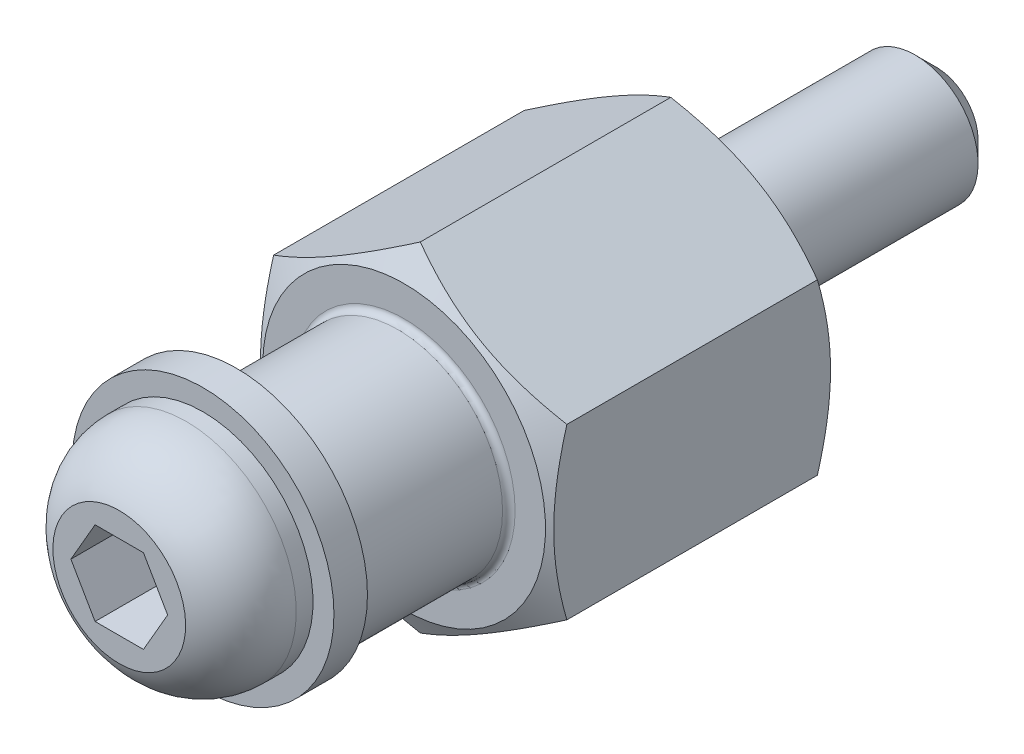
ISO-10303-21;
HEADER;
FILE_DESCRIPTION(('STEP AP214'),'2;1');
FILE_NAME('part.step','',(''),(''),'','','');
FILE_SCHEMA(('AUTOMOTIVE_DESIGN { 1 0 10303 214 1 1 1 1 }'));
ENDSEC;
DATA;
#1=APPLICATION_CONTEXT('core data for automotive mechanical design processes');
#2=APPLICATION_PROTOCOL_DEFINITION('international standard','automotive_design',2000,#1);
#3=PRODUCT_CONTEXT('',#1,'mechanical');
#4=PRODUCT('Part','Part','',(#3));
#5=PRODUCT_RELATED_PRODUCT_CATEGORY('part','',(#4));
#6=PRODUCT_DEFINITION_FORMATION('','',#4);
#7=PRODUCT_DEFINITION_CONTEXT('part definition',#1,'design');
#8=PRODUCT_DEFINITION('design','',#6,#7);
#9=PRODUCT_DEFINITION_SHAPE('','',#8);
#10=(LENGTH_UNIT() NAMED_UNIT(*) SI_UNIT(.MILLI.,.METRE.));
#11=(NAMED_UNIT(*) PLANE_ANGLE_UNIT() SI_UNIT($,.RADIAN.));
#12=(NAMED_UNIT(*) SI_UNIT($,.STERADIAN.) SOLID_ANGLE_UNIT());
#13=UNCERTAINTY_MEASURE_WITH_UNIT(LENGTH_MEASURE(1.E-05),#10,'distance_accuracy_value','');
#14=(GEOMETRIC_REPRESENTATION_CONTEXT(3) GLOBAL_UNCERTAINTY_ASSIGNED_CONTEXT((#13)) GLOBAL_UNIT_ASSIGNED_CONTEXT((#10,
#11,#12)) REPRESENTATION_CONTEXT('',''));
#15=CARTESIAN_POINT('',(0.,0.,0.));
#16=DIRECTION('',(0.,0.,1.));
#17=DIRECTION('',(1.,0.,0.));
#18=AXIS2_PLACEMENT_3D('',#15,#16,#17);
#19=CARTESIAN_POINT('',(0.,-9.08290376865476,21.));
#20=DIRECTION('',(-0.5,-0.866025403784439,0.));
#21=DIRECTION('',(-0.866025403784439,0.5,0.));
#22=AXIS2_PLACEMENT_3D('',#19,#20,#21);
#23=PLANE('',#22);
#24=DIRECTION('',(0.,0.,-1.));
#25=VECTOR('',#24,1.);
#26=CARTESIAN_POINT('',(-7.,-5.04145188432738,21.));
#27=LINE('',#26,#25);
#28=CARTESIAN_POINT('',(-7.,-5.04145188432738,12.7304476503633));
#29=VERTEX_POINT('',#28);
#30=CARTESIAN_POINT('',(-7.,-5.04145188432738,0.769552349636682));
#31=VERTEX_POINT('',#30);
#32=EDGE_CURVE('E126',#29,#31,#27,.T.);
#33=ORIENTED_EDGE('',*,*,#32,.T.);
#34=CARTESIAN_POINT('',(-7.0002,-5.04133641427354,0.7696190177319));
#35=CARTESIAN_POINT('',(-6.84633209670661,-5.13017208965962,0.718337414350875));
#36=CARTESIAN_POINT('',(-6.69189049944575,-5.21933898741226,0.66938316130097));
#37=CARTESIAN_POINT('',(-6.38175307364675,-5.39839691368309,0.576770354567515));
#38=CARTESIAN_POINT('',(-6.22605673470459,-5.48828823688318,0.533114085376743));
#39=CARTESIAN_POINT('',(-5.75647483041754,-5.75940147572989,0.410949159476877));
#40=CARTESIAN_POINT('',(-5.4407356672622,-5.94169356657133,0.341463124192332));
#41=CARTESIAN_POINT('',(-4.96823775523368,-6.21449036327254,0.259982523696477));
#42=CARTESIAN_POINT('',(-4.81289077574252,-6.30417998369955,0.236771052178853));
#43=CARTESIAN_POINT('',(-4.50149488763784,-6.48396448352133,0.197848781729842));
#44=CARTESIAN_POINT('',(-4.3454460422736,-6.57405932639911,0.18213732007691));
#45=CARTESIAN_POINT('',(-4.03307732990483,-6.75440548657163,0.158615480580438));
#46=CARTESIAN_POINT('',(-3.87675797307,-6.84465650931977,0.150796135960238));
#47=CARTESIAN_POINT('',(-3.56398349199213,-7.02523694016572,0.143217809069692));
#48=CARTESIAN_POINT('',(-3.40752837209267,-7.11556634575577,0.143458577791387));
#49=CARTESIAN_POINT('',(-2.97889312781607,-7.36303901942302,0.155197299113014));
#50=CARTESIAN_POINT('',(-2.7068533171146,-7.52010127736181,0.174903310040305));
#51=CARTESIAN_POINT('',(-2.16458055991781,-7.83318259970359,0.23739102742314));
#52=CARTESIAN_POINT('',(-1.89434952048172,-7.9892005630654,0.280194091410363));
#53=CARTESIAN_POINT('',(-1.35098545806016,-8.30291195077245,0.387189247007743));
#54=CARTESIAN_POINT('',(-1.07792099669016,-8.46056579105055,0.451834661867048));
#55=CARTESIAN_POINT('',(-0.535864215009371,-8.77352241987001,0.598553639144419));
#56=CARTESIAN_POINT('',(-0.26686495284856,-8.92882921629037,0.680592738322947));
#57=CARTESIAN_POINT('',(0.000199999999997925,-9.0830192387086,0.769619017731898));
#58=B_SPLINE_CURVE_WITH_KNOTS('',3,(#34,#35,#36,#37,#38,#39,#40,#41,#42,#43,#44,#45,#46,#47,#48,
#49,#50,#51,#52,#53,#54,#55,#56,#57),.UNSPECIFIED.,.F.,.F.,(4,2,2,2,2,2,2,2,2,2,2,4),(0.,
0.554727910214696,1.10969417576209,2.2219327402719,2.76443041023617,3.30688013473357,
3.8487128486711,4.39052882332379,5.33376515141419,6.27787517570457,7.2429241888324,
8.20607866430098),.UNSPECIFIED.);
#59=CARTESIAN_POINT('',(0.,-9.08290376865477,0.769552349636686));
#60=VERTEX_POINT('',#59);
#61=EDGE_CURVE('E29',#31,#60,#58,.T.);
#62=ORIENTED_EDGE('',*,*,#61,.T.);
#63=DIRECTION('',(0.,0.,-1.));
#64=VECTOR('',#63,1.);
#65=CARTESIAN_POINT('',(0.,-9.08290376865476,21.));
#66=LINE('',#65,#64);
#67=CARTESIAN_POINT('',(0.,-9.08290376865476,12.7304476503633));
#68=VERTEX_POINT('',#67);
#69=EDGE_CURVE('E131',#68,#60,#66,.T.);
#70=ORIENTED_EDGE('',*,*,#69,.F.);
#71=CARTESIAN_POINT('',(-7.0002,-5.04133641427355,12.7303809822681));
#72=CARTESIAN_POINT('',(-6.84633209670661,-5.13017208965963,12.7816625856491));
#73=CARTESIAN_POINT('',(-6.69189049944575,-5.21933898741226,12.830616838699));
#74=CARTESIAN_POINT('',(-6.38175307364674,-5.39839691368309,12.9232296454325));
#75=CARTESIAN_POINT('',(-6.22605673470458,-5.48828823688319,12.9668859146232));
#76=CARTESIAN_POINT('',(-5.75647483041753,-5.7594014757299,13.0890508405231));
#77=CARTESIAN_POINT('',(-5.4407356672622,-5.94169356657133,13.1585368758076));
#78=CARTESIAN_POINT('',(-4.96823775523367,-6.21449036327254,13.2400174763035));
#79=CARTESIAN_POINT('',(-4.81289077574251,-6.30417998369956,13.2632289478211));
#80=CARTESIAN_POINT('',(-4.50149488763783,-6.48396448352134,13.3021512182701));
#81=CARTESIAN_POINT('',(-4.34544604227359,-6.57405932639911,13.3178626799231));
#82=CARTESIAN_POINT('',(-4.03307732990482,-6.75440548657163,13.3413845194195));
#83=CARTESIAN_POINT('',(-3.87675797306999,-6.84465650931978,13.3492038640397));
#84=CARTESIAN_POINT('',(-3.56398349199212,-7.02523694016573,13.3567821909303));
#85=CARTESIAN_POINT('',(-3.40752837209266,-7.11556634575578,13.3565414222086));
#86=CARTESIAN_POINT('',(-2.97889312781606,-7.36303901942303,13.344802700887));
#87=CARTESIAN_POINT('',(-2.7068533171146,-7.52010127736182,13.3250966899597));
#88=CARTESIAN_POINT('',(-2.1645805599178,-7.83318259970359,13.2626089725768));
#89=CARTESIAN_POINT('',(-1.89434952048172,-7.9892005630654,13.2198059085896));
#90=CARTESIAN_POINT('',(-1.35098545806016,-8.30291195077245,13.1128107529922));
#91=CARTESIAN_POINT('',(-1.07792099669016,-8.46056579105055,13.0481653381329));
#92=CARTESIAN_POINT('',(-0.535864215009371,-8.77352241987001,12.9014463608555));
#93=CARTESIAN_POINT('',(-0.266864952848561,-8.92882921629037,12.819407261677));
#94=CARTESIAN_POINT('',(0.000199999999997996,-9.0830192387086,12.7303809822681));
#95=B_SPLINE_CURVE_WITH_KNOTS('',3,(#71,#72,#73,#74,#75,#76,#77,#78,#79,#80,#81,#82,#83,#84,#85,
#86,#87,#88,#89,#90,#91,#92,#93,#94),.UNSPECIFIED.,.F.,.F.,(4,2,2,2,2,2,2,2,2,2,2,4),(0.,
0.554727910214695,1.10969417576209,2.2219327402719,2.76443041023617,3.30688013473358,
3.8487128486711,4.39052882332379,5.33376515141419,6.27787517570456,7.2429241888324,
8.20607866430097),.UNSPECIFIED.);
#96=EDGE_CURVE('E203',#29,#68,#95,.T.);
#97=ORIENTED_EDGE('',*,*,#96,.F.);
#98=EDGE_LOOP('',(#33,#62,#70,#97));
#99=FACE_BOUND('',#98,.T.);
#100=ADVANCED_FACE('F14',(#99),#23,.T.);
#101=CARTESIAN_POINT('',(7.,-5.04145188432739,21.));
#102=DIRECTION('',(0.5,-0.866025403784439,0.));
#103=DIRECTION('',(-0.866025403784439,-0.5,0.));
#104=AXIS2_PLACEMENT_3D('',#101,#102,#103);
#105=PLANE('',#104);
#106=ORIENTED_EDGE('',*,*,#69,.T.);
#107=CARTESIAN_POINT('',(-0.000200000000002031,-9.08301923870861,0.769619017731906));
#108=CARTESIAN_POINT('',(0.153667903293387,-8.99418356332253,0.718337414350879));
#109=CARTESIAN_POINT('',(0.308109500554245,-8.90501666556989,0.669383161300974));
#110=CARTESIAN_POINT('',(0.618246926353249,-8.72595873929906,0.576770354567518));
#111=CARTESIAN_POINT('',(0.773943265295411,-8.63606741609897,0.533114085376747));
#112=CARTESIAN_POINT('',(1.24352516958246,-8.36495417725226,0.410949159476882));
#113=CARTESIAN_POINT('',(1.5592643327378,-8.18266208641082,0.341463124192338));
#114=CARTESIAN_POINT('',(2.03176224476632,-7.90986528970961,0.259982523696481));
#115=CARTESIAN_POINT('',(2.18710922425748,-7.8201756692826,0.236771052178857));
#116=CARTESIAN_POINT('',(2.49850511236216,-7.64039116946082,0.197848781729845));
#117=CARTESIAN_POINT('',(2.6545539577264,-7.55029632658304,0.182137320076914));
#118=CARTESIAN_POINT('',(2.96692267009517,-7.36995016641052,0.158615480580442));
#119=CARTESIAN_POINT('',(3.12324202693,-7.27969914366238,0.150796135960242));
#120=CARTESIAN_POINT('',(3.43601650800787,-7.09911871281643,0.143217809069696));
#121=CARTESIAN_POINT('',(3.59247162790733,-7.00878930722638,0.143458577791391));
#122=CARTESIAN_POINT('',(4.02110687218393,-6.76131663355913,0.155197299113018));
#123=CARTESIAN_POINT('',(4.2931466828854,-6.60425437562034,0.17490331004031));
#124=CARTESIAN_POINT('',(4.8354194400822,-6.29117305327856,0.237391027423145));
#125=CARTESIAN_POINT('',(5.10565047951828,-6.13515508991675,0.280194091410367));
#126=CARTESIAN_POINT('',(5.64901454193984,-5.82144370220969,0.387189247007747));
#127=CARTESIAN_POINT('',(5.92207900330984,-5.6637898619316,0.451834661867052));
#128=CARTESIAN_POINT('',(6.46413578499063,-5.35083323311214,0.598553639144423));
#129=CARTESIAN_POINT('',(6.73313504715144,-5.19552643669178,0.680592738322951));
#130=CARTESIAN_POINT('',(7.0002,-5.04133641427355,0.769619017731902));
#131=B_SPLINE_CURVE_WITH_KNOTS('',3,(#107,#108,#109,#110,#111,#112,#113,#114,#115,#116,#117,
#118,#119,#120,#121,#122,#123,#124,#125,#126,#127,#128,#129,#130),.UNSPECIFIED.,.F.,.F.,(4,2,2,
2,2,2,2,2,2,2,2,4),(0.,0.554727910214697,1.10969417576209,2.2219327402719,2.76443041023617,
3.30688013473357,3.8487128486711,4.39052882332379,5.33376515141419,6.27787517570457,
7.24292418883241,8.20607866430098),.UNSPECIFIED.);
#132=CARTESIAN_POINT('',(7.,-5.04145188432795,0.769552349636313));
#133=VERTEX_POINT('',#132);
#134=EDGE_CURVE('E254',#60,#133,#131,.T.);
#135=ORIENTED_EDGE('',*,*,#134,.T.);
#136=DIRECTION('',(0.,0.,-1.));
#137=VECTOR('',#136,1.);
#138=CARTESIAN_POINT('',(7.,-5.04145188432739,21.));
#139=LINE('',#138,#137);
#140=CARTESIAN_POINT('',(7.,-5.04145188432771,12.7304476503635));
#141=VERTEX_POINT('',#140);
#142=EDGE_CURVE('E139',#141,#133,#139,.T.);
#143=ORIENTED_EDGE('',*,*,#142,.F.);
#144=CARTESIAN_POINT('',(-0.000200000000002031,-9.0830192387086,12.7303809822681));
#145=CARTESIAN_POINT('',(0.153667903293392,-8.99418356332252,12.7816625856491));
#146=CARTESIAN_POINT('',(0.308109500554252,-8.90501666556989,12.830616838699));
#147=CARTESIAN_POINT('',(0.618246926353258,-8.72595873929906,12.9232296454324));
#148=CARTESIAN_POINT('',(0.773943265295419,-8.63606741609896,12.9668859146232));
#149=CARTESIAN_POINT('',(1.24352516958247,-8.36495417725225,13.0890508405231));
#150=CARTESIAN_POINT('',(1.55926433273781,-8.18266208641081,13.1585368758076));
#151=CARTESIAN_POINT('',(2.03176224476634,-7.90986528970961,13.2400174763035));
#152=CARTESIAN_POINT('',(2.18710922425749,-7.82017566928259,13.2632289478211));
#153=CARTESIAN_POINT('',(2.49850511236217,-7.64039116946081,13.3021512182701));
#154=CARTESIAN_POINT('',(2.65455395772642,-7.55029632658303,13.3178626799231));
#155=CARTESIAN_POINT('',(2.96692267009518,-7.36995016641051,13.3413845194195));
#156=CARTESIAN_POINT('',(3.12324202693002,-7.27969914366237,13.3492038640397));
#157=CARTESIAN_POINT('',(3.43601650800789,-7.09911871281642,13.3567821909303));
#158=CARTESIAN_POINT('',(3.59247162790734,-7.00878930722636,13.3565414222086));
#159=CARTESIAN_POINT('',(4.02110687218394,-6.7613166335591,13.344802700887));
#160=CARTESIAN_POINT('',(4.29314668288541,-6.60425437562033,13.3250966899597));
#161=CARTESIAN_POINT('',(4.8354194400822,-6.29117305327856,13.2626089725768));
#162=CARTESIAN_POINT('',(5.10565047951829,-6.13515508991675,13.2198059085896));
#163=CARTESIAN_POINT('',(5.64901454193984,-5.82144370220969,13.1128107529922));
#164=CARTESIAN_POINT('',(5.92207900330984,-5.6637898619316,13.0481653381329));
#165=CARTESIAN_POINT('',(6.46413578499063,-5.35083323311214,12.9014463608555));
#166=CARTESIAN_POINT('',(6.73313504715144,-5.19552643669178,12.819407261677));
#167=CARTESIAN_POINT('',(7.0002,-5.04133641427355,12.7303809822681));
#168=B_SPLINE_CURVE_WITH_KNOTS('',3,(#144,#145,#146,#147,#148,#149,#150,#151,#152,#153,#154,
#155,#156,#157,#158,#159,#160,#161,#162,#163,#164,#165,#166,#167),.UNSPECIFIED.,.F.,.F.,(4,2,2,
2,2,2,2,2,2,2,2,4),(0.,0.554727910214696,1.10969417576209,2.22193274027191,2.76443041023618,
3.30688013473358,3.84871284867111,4.3905288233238,5.33376515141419,6.27787517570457,
7.2429241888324,8.20607866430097),.UNSPECIFIED.);
#169=EDGE_CURVE('E196',#68,#141,#168,.T.);
#170=ORIENTED_EDGE('',*,*,#169,.F.);
#171=EDGE_LOOP('',(#106,#135,#143,#170));
#172=FACE_BOUND('',#171,.T.);
#173=ADVANCED_FACE('F264',(#172),#105,.T.);
#174=CARTESIAN_POINT('',(7.,3.04145188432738,21.));
#175=DIRECTION('',(1.,0.,0.));
#176=DIRECTION('',(0.,-1.,0.));
#177=AXIS2_PLACEMENT_3D('',#174,#175,#176);
#178=PLANE('',#177);
#179=ORIENTED_EDGE('',*,*,#142,.T.);
#180=CARTESIAN_POINT('',(7.,-11.952394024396,3.60743840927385));
#181=CARTESIAN_POINT('',(7.,-11.645833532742,3.45834342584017));
#182=CARTESIAN_POINT('',(6.99999999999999,-11.3385796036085,3.31065035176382));
#183=CARTESIAN_POINT('',(6.99999999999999,-10.7223164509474,3.0188545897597));
#184=CARTESIAN_POINT('',(6.99999999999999,-10.4133069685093,2.87475244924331));
#185=CARTESIAN_POINT('',(6.99999999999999,-9.79161803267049,2.59022068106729));
#186=CARTESIAN_POINT('',(6.99999999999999,-9.47892781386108,2.44981449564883));
#187=CARTESIAN_POINT('',(6.99999999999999,-8.85109396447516,2.17462039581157));
#188=CARTESIAN_POINT('',(6.99999999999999,-8.53595044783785,2.03983222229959));
#189=CARTESIAN_POINT('',(6.99999999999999,-7.89217370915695,1.77298744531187));
#190=CARTESIAN_POINT('',(7.,-7.56344046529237,1.6411708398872));
#191=CARTESIAN_POINT('',(7.,-6.9021646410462,1.38728212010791));
#192=CARTESIAN_POINT('',(7.,-6.56962164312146,1.26521108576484));
#193=CARTESIAN_POINT('',(7.,-5.90078503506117,1.03394781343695));
#194=CARTESIAN_POINT('',(7.,-5.5645002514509,0.924730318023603));
#195=CARTESIAN_POINT('',(7.,-4.8871193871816,0.72261355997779));
#196=CARTESIAN_POINT('',(7.,-4.54602482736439,0.629709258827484));
#197=CARTESIAN_POINT('',(7.,-3.86068615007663,0.465117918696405));
#198=CARTESIAN_POINT('',(7.,-3.51647127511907,0.393312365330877));
#199=CARTESIAN_POINT('',(7.,-2.99693811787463,0.304486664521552));
#200=CARTESIAN_POINT('',(7.,-2.82321302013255,0.278024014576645));
#201=CARTESIAN_POINT('',(7.,-2.47486768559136,0.231909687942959));
#202=CARTESIAN_POINT('',(7.,-2.30024754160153,0.212257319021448));
#203=CARTESIAN_POINT('',(7.,-1.95266844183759,0.180406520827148));
#204=CARTESIAN_POINT('',(7.,-1.77971829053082,0.168112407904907));
#205=CARTESIAN_POINT('',(7.,-1.43345274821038,0.150853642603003));
#206=CARTESIAN_POINT('',(7.,-1.26013736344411,0.145888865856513));
#207=CARTESIAN_POINT('',(7.,-0.913451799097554,0.143407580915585));
#208=CARTESIAN_POINT('',(7.,-0.740081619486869,0.145891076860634));
#209=CARTESIAN_POINT('',(7.,-0.393602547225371,0.158244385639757));
#210=CARTESIAN_POINT('',(7.,-0.220493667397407,0.168114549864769));
#211=CARTESIAN_POINT('',(7.,0.192638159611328,0.200273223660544));
#212=CARTESIAN_POINT('',(7.,0.432406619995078,0.225905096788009));
#213=CARTESIAN_POINT('',(7.,0.910215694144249,0.289963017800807));
#214=CARTESIAN_POINT('',(7.,1.14825607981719,0.328390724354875));
#215=CARTESIAN_POINT('',(7.,1.85948345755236,0.460834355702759));
#216=CARTESIAN_POINT('',(7.,2.3295241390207,0.571988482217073));
#217=CARTESIAN_POINT('',(7.,3.03250592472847,0.765407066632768));
#218=CARTESIAN_POINT('',(7.,3.26907523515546,0.83524909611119));
#219=CARTESIAN_POINT('',(7.,3.73991776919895,0.982354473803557));
#220=CARTESIAN_POINT('',(7.,3.97419097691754,1.05961787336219));
#221=CARTESIAN_POINT('',(7.,4.44051196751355,1.22031247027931));
#222=CARTESIAN_POINT('',(7.,4.67256041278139,1.30374176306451));
#223=CARTESIAN_POINT('',(7.,5.13472329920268,1.47576985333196));
#224=CARTESIAN_POINT('',(7.,5.36483776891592,1.5643685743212));
#225=CARTESIAN_POINT('',(7.,5.93002698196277,1.78811126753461));
#226=CARTESIAN_POINT('',(7.,6.26412008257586,1.92573111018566));
#227=CARTESIAN_POINT('',(7.,6.92926978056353,2.20814565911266));
#228=CARTESIAN_POINT('',(7.,7.26032614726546,2.35294090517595));
#229=CARTESIAN_POINT('',(7.,7.92000588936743,2.64819171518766));
#230=CARTESIAN_POINT('',(7.,8.24862857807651,2.79864880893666));
#231=CARTESIAN_POINT('',(7.,8.9037812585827,3.10401761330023));
#232=CARTESIAN_POINT('',(7.,9.2303113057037,3.25892920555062));
#233=CARTESIAN_POINT('',(7.,9.88205674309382,3.57252829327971));
#234=CARTESIAN_POINT('',(7.,10.2072699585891,3.73122030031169));
#235=CARTESIAN_POINT('',(7.,10.8562553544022,4.05152338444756));
#236=CARTESIAN_POINT('',(7.,11.1800275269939,4.2131344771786));
#237=CARTESIAN_POINT('',(7.,12.1494433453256,4.70148336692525));
#238=CARTESIAN_POINT('',(7.,12.793290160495,5.03178719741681));
#239=CARTESIAN_POINT('',(7.,14.0194435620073,5.66878421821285));
#240=CARTESIAN_POINT('',(7.00000000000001,14.602046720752,5.97490919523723));
#241=CARTESIAN_POINT('',(7.00000000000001,15.7651259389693,6.59123107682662));
#242=CARTESIAN_POINT('',(7.00000000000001,16.3456019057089,6.90142815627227));
#243=CARTESIAN_POINT('',(7.00000000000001,17.5032798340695,7.52402159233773));
#244=CARTESIAN_POINT('',(7.00000000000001,18.0804864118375,7.83640937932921));
#245=CARTESIAN_POINT('',(7.00000000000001,19.2335521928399,8.46357727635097));
#246=CARTESIAN_POINT('',(7.,19.809411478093,8.7783572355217));
#247=CARTESIAN_POINT('',(7.,20.3847818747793,9.09402235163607));
#248=B_SPLINE_CURVE_WITH_KNOTS('',3,(#180,#181,#182,#183,#184,#185,#186,#187,#188,#189,#190,
#191,#192,#193,#194,#195,#196,#197,#198,#199,#200,#201,#202,#203,#204,#205,#206,#207,#208,#209,
#210,#211,#212,#213,#214,#215,#216,#217,#218,#219,#220,#221,#222,#223,#224,#225,#226,#227,#228,
#229,#230,#231,#232,#233,#234,#235,#236,#237,#238,#239,#240,#241,#242,#243,#244,#245,#246,#247),
.UNSPECIFIED.,.F.,.F.,(4,2,2,2,2,2,2,2,2,2,2,2,2,2,2,2,2,2,2,2,2,2,2,2,2,2,2,2,2,2,2,2,2,4),(0.,
1.02269371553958,2.0455423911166,3.07379840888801,4.10200695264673,5.16441719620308,
6.22694501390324,7.28734879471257,8.34742447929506,9.40142646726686,9.92850104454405,
10.4555220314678,10.9755319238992,11.4955329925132,12.0155343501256,12.5355604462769,
13.2585577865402,13.9816488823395,15.4285881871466,16.1685148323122,16.9084465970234,
17.648150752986,18.3878439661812,19.4717092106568,20.5556561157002,21.6398980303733,
22.7241111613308,23.8096903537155,24.8952753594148,27.0660990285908,29.0404808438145,
31.0149477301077,32.9838962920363,34.9527216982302),.UNSPECIFIED.);
#249=CARTESIAN_POINT('',(7.,3.04145188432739,0.769552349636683));
#250=VERTEX_POINT('',#249);
#251=EDGE_CURVE('E248',#133,#250,#248,.T.);
#252=ORIENTED_EDGE('',*,*,#251,.T.);
#253=DIRECTION('',(0.,0.,-1.));
#254=VECTOR('',#253,1.);
#255=CARTESIAN_POINT('',(7.,3.04145188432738,21.));
#256=LINE('',#255,#254);
#257=CARTESIAN_POINT('',(7.,3.04145188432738,12.7304476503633));
#258=VERTEX_POINT('',#257);
#259=EDGE_CURVE('E142',#258,#250,#256,.T.);
#260=ORIENTED_EDGE('',*,*,#259,.F.);
#261=CARTESIAN_POINT('',(7.,-12.0252402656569,9.8570894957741));
#262=CARTESIAN_POINT('',(7.,-11.7179968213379,10.0068034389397));
#263=CARTESIAN_POINT('',(6.99999999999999,-11.4100659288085,10.1551298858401));
#264=CARTESIAN_POINT('',(6.99999999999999,-10.7924641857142,10.4482305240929));
#265=CARTESIAN_POINT('',(6.99999999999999,-10.4827930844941,10.59300418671));
#266=CARTESIAN_POINT('',(6.99999999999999,-9.85983065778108,10.8789142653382));
#267=CARTESIAN_POINT('',(6.99999999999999,-9.54652889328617,11.0200280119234));
#268=CARTESIAN_POINT('',(6.99999999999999,-8.91749157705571,11.2967012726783));
#269=CARTESIAN_POINT('',(6.99999999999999,-8.60175613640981,11.4322610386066));
#270=CARTESIAN_POINT('',(6.99999999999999,-7.95662256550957,11.7008308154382));
#271=CARTESIAN_POINT('',(7.,-7.62712346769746,11.833599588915));
#272=CARTESIAN_POINT('',(7.,-6.96433446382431,12.0894927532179));
#273=CARTESIAN_POINT('',(7.,-6.63104414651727,12.2126160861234));
#274=CARTESIAN_POINT('',(7.,-5.96070886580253,12.4461100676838));
#275=CARTESIAN_POINT('',(7.,-5.6236724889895,12.5565051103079));
#276=CARTESIAN_POINT('',(7.,-4.94478010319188,12.7611140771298));
#277=CARTESIAN_POINT('',(7.,-4.60292559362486,12.8553329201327));
#278=CARTESIAN_POINT('',(7.,-3.91602933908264,13.0226788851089));
#279=CARTESIAN_POINT('',(7.,-3.57101701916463,13.0959235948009));
#280=CARTESIAN_POINT('',(7.,-3.05022569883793,13.1869675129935));
#281=CARTESIAN_POINT('',(7.,-2.87607165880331,13.2141794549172));
#282=CARTESIAN_POINT('',(7.,-2.52684240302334,13.2617996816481));
#283=CARTESIAN_POINT('',(7.,-2.35176728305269,13.2822086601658));
#284=CARTESIAN_POINT('',(7.,-2.00329059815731,13.31555138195));
#285=CARTESIAN_POINT('',(7.,-1.82989838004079,13.3285823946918));
#286=CARTESIAN_POINT('',(7.,-1.48271767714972,13.3472933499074));
#287=CARTESIAN_POINT('',(7.,-1.30892919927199,13.3529734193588));
#288=CARTESIAN_POINT('',(7.,-0.961266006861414,13.3568462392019));
#289=CARTESIAN_POINT('',(7.,-0.787391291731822,13.3550389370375));
#290=CARTESIAN_POINT('',(7.,-0.439876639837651,13.3439829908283));
#291=CARTESIAN_POINT('',(7.,-0.266236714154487,13.3347340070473));
#292=CARTESIAN_POINT('',(7.,0.145964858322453,13.3041446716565));
#293=CARTESIAN_POINT('',(7.,0.384291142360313,13.2795579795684));
#294=CARTESIAN_POINT('',(7.,0.859273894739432,13.2176689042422));
#295=CARTESIAN_POINT('',(7.,1.0959301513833,13.1803649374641));
#296=CARTESIAN_POINT('',(7.,1.80305957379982,13.0513472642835));
#297=CARTESIAN_POINT('',(7.,2.27046212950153,12.9425473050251));
#298=CARTESIAN_POINT('',(7.,2.96975920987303,12.7525739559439));
#299=CARTESIAN_POINT('',(7.,3.20524233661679,12.6838396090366));
#300=CARTESIAN_POINT('',(7.,3.67392424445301,12.5389105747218));
#301=CARTESIAN_POINT('',(7.,3.90712300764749,12.4627158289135));
#302=CARTESIAN_POINT('',(7.,4.37130662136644,12.3041150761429));
#303=CARTESIAN_POINT('',(7.,4.60229206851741,12.2217107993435));
#304=CARTESIAN_POINT('',(7.,5.0623248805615,12.0516926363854));
#305=CARTESIAN_POINT('',(7.,5.29137229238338,11.9640788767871));
#306=CARTESIAN_POINT('',(7.,5.91684977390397,11.7179701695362));
#307=CARTESIAN_POINT('',(7.,6.31154127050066,11.5550605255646));
#308=CARTESIAN_POINT('',(7.,7.09678221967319,11.2195115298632));
#309=CARTESIAN_POINT('',(7.,7.48733117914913,11.0468710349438));
#310=CARTESIAN_POINT('',(7.,8.26525895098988,10.6942040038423));
#311=CARTESIAN_POINT('',(7.,8.65263641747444,10.5141745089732));
#312=CARTESIAN_POINT('',(7.,9.42471557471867,10.1485283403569));
#313=CARTESIAN_POINT('',(7.,9.80941738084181,9.96291190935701));
#314=CARTESIAN_POINT('',(7.,10.5773250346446,9.58701466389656));
#315=CARTESIAN_POINT('',(7.,10.9605273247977,9.39672659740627));
#316=CARTESIAN_POINT('',(7.,11.7252005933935,9.0127005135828));
#317=CARTESIAN_POINT('',(7.,12.1066715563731,8.81896246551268));
#318=CARTESIAN_POINT('',(7.,12.868107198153,8.42876899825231));
#319=CARTESIAN_POINT('',(7.,13.2480722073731,8.23231422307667));
#320=CARTESIAN_POINT('',(7.,14.0068329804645,7.83715827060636));
#321=CARTESIAN_POINT('',(7.00000000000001,14.3856287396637,7.63845708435));
#322=CARTESIAN_POINT('',(7.00000000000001,15.4385377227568,7.08288077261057));
#323=CARTESIAN_POINT('',(7.00000000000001,16.1115949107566,6.7240047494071));
#324=CARTESIAN_POINT('',(7.00000000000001,17.4554853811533,6.00201748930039));
#325=CARTESIAN_POINT('',(7.00000000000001,18.1263185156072,5.63890597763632));
#326=CARTESIAN_POINT('',(7.00000000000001,19.4639671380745,4.91079943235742));
#327=CARTESIAN_POINT('',(7.00000000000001,20.130788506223,4.54581519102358));
#328=CARTESIAN_POINT('',(7.00000000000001,21.4630423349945,3.81344867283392));
#329=CARTESIAN_POINT('',(7.00000000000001,22.1284749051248,3.4460665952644));
#330=CARTESIAN_POINT('',(7.,22.7934226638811,3.07781542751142));
#331=B_SPLINE_CURVE_WITH_KNOTS('',3,(#261,#262,#263,#264,#265,#266,#267,#268,#269,#270,#271,
#272,#273,#274,#275,#276,#277,#278,#279,#280,#281,#282,#283,#284,#285,#286,#287,#288,#289,#290,
#291,#292,#293,#294,#295,#296,#297,#298,#299,#300,#301,#302,#303,#304,#305,#306,#307,#308,#309,
#310,#311,#312,#313,#314,#315,#316,#317,#318,#319,#320,#321,#322,#323,#324,#325,#326,#327,#328,
#329,#330),.UNSPECIFIED.,.F.,.F.,(4,2,2,2,2,2,2,2,2,2,2,2,2,2,2,2,2,2,2,2,2,2,2,2,2,2,2,2,2,2,2,
2,2,2,4),(0.,1.02534835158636,2.05084838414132,3.0816492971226,4.11240343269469,
5.17801349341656,6.24374026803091,7.3073893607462,8.3707144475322,9.42795594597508,
9.95664563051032,10.485281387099,11.0067749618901,11.528259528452,12.049747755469,
12.5712597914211,13.2896310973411,14.0080918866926,15.4457065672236,16.181568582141,
16.9174363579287,17.6530998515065,18.3887454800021,19.6695196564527,20.9504446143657,
22.2318875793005,23.5132749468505,24.7967959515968,26.0803283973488,27.3635616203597,
28.6467999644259,30.9350469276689,33.2234431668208,35.5039589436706,37.7842875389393),.UNSPECIFIED.);
#332=EDGE_CURVE('E188',#141,#258,#331,.T.);
#333=ORIENTED_EDGE('',*,*,#332,.F.);
#334=EDGE_LOOP('',(#179,#252,#260,#333));
#335=FACE_BOUND('',#334,.T.);
#336=ADVANCED_FACE('F267',(#335),#178,.T.);
#337=CARTESIAN_POINT('',(0.,7.08290376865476,21.));
#338=DIRECTION('',(0.5,0.866025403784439,0.));
#339=DIRECTION('',(0.866025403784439,-0.5,0.));
#340=AXIS2_PLACEMENT_3D('',#337,#338,#339);
#341=PLANE('',#340);
#342=ORIENTED_EDGE('',*,*,#259,.T.);
#343=CARTESIAN_POINT('',(7.0002,3.04133641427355,0.7696190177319));
#344=CARTESIAN_POINT('',(6.84633209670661,3.13017208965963,0.718337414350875));
#345=CARTESIAN_POINT('',(6.69189049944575,3.21933898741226,0.66938316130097));
#346=CARTESIAN_POINT('',(6.38175307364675,3.39839691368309,0.576770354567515));
#347=CARTESIAN_POINT('',(6.22605673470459,3.48828823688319,0.533114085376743));
#348=CARTESIAN_POINT('',(5.75647483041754,3.75940147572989,0.410949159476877));
#349=CARTESIAN_POINT('',(5.4407356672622,3.94169356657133,0.341463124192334));
#350=CARTESIAN_POINT('',(4.96823775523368,4.21449036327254,0.259982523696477));
#351=CARTESIAN_POINT('',(4.81289077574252,4.30417998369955,0.236771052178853));
#352=CARTESIAN_POINT('',(4.50149488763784,4.48396448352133,0.197848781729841));
#353=CARTESIAN_POINT('',(4.3454460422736,4.57405932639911,0.18213732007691));
#354=CARTESIAN_POINT('',(4.03307732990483,4.75440548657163,0.158615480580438));
#355=CARTESIAN_POINT('',(3.87675797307,4.84465650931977,0.150796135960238));
#356=CARTESIAN_POINT('',(3.56398349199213,5.02523694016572,0.143217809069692));
#357=CARTESIAN_POINT('',(3.40752837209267,5.11556634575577,0.143458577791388));
#358=CARTESIAN_POINT('',(2.97889312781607,5.36303901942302,0.155197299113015));
#359=CARTESIAN_POINT('',(2.7068533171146,5.52010127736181,0.174903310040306));
#360=CARTESIAN_POINT('',(2.16458055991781,5.83318259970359,0.237391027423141));
#361=CARTESIAN_POINT('',(1.89434952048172,5.9892005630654,0.280194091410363));
#362=CARTESIAN_POINT('',(1.35098545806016,6.30291195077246,0.387189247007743));
#363=CARTESIAN_POINT('',(1.07792099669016,6.46056579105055,0.451834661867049));
#364=CARTESIAN_POINT('',(0.535864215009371,6.77352241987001,0.598553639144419));
#365=CARTESIAN_POINT('',(0.266864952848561,6.92882921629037,0.680592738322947));
#366=CARTESIAN_POINT('',(-0.000199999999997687,7.0830192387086,0.769619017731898));
#367=B_SPLINE_CURVE_WITH_KNOTS('',3,(#343,#344,#345,#346,#347,#348,#349,#350,#351,#352,#353,
#354,#355,#356,#357,#358,#359,#360,#361,#362,#363,#364,#365,#366),.UNSPECIFIED.,.F.,.F.,(4,2,2,
2,2,2,2,2,2,2,2,4),(0.,0.554727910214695,1.10969417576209,2.2219327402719,2.76443041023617,
3.30688013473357,3.8487128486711,4.39052882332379,5.33376515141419,6.27787517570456,
7.2429241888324,8.20607866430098),.UNSPECIFIED.);
#368=CARTESIAN_POINT('',(0.,7.08290376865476,0.769552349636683));
#369=VERTEX_POINT('',#368);
#370=EDGE_CURVE('E120',#250,#369,#367,.T.);
#371=ORIENTED_EDGE('',*,*,#370,.T.);
#372=DIRECTION('',(0.,0.,-1.));
#373=VECTOR('',#372,1.);
#374=CARTESIAN_POINT('',(0.,7.08290376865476,21.));
#375=LINE('',#374,#373);
#376=CARTESIAN_POINT('',(0.,7.08290376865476,12.7304476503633));
#377=VERTEX_POINT('',#376);
#378=EDGE_CURVE('E119',#377,#369,#375,.T.);
#379=ORIENTED_EDGE('',*,*,#378,.F.);
#380=CARTESIAN_POINT('',(7.0002,3.04133641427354,12.7303809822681));
#381=CARTESIAN_POINT('',(6.84633209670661,3.13017208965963,12.7816625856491));
#382=CARTESIAN_POINT('',(6.69189049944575,3.21933898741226,12.830616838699));
#383=CARTESIAN_POINT('',(6.38175307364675,3.39839691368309,12.9232296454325));
#384=CARTESIAN_POINT('',(6.22605673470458,3.48828823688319,12.9668859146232));
#385=CARTESIAN_POINT('',(5.75647483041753,3.75940147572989,13.0890508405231));
#386=CARTESIAN_POINT('',(5.4407356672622,3.94169356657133,13.1585368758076));
#387=CARTESIAN_POINT('',(4.96823775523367,4.21449036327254,13.2400174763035));
#388=CARTESIAN_POINT('',(4.81289077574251,4.30417998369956,13.2632289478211));
#389=CARTESIAN_POINT('',(4.50149488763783,4.48396448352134,13.3021512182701));
#390=CARTESIAN_POINT('',(4.34544604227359,4.57405932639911,13.3178626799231));
#391=CARTESIAN_POINT('',(4.03307732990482,4.75440548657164,13.3413845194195));
#392=CARTESIAN_POINT('',(3.87675797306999,4.84465650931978,13.3492038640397));
#393=CARTESIAN_POINT('',(3.56398349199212,5.02523694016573,13.3567821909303));
#394=CARTESIAN_POINT('',(3.40752837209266,5.11556634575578,13.3565414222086));
#395=CARTESIAN_POINT('',(2.97889312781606,5.36303901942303,13.344802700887));
#396=CARTESIAN_POINT('',(2.7068533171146,5.52010127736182,13.3250966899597));
#397=CARTESIAN_POINT('',(2.1645805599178,5.83318259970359,13.2626089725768));
#398=CARTESIAN_POINT('',(1.89434952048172,5.9892005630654,13.2198059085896));
#399=CARTESIAN_POINT('',(1.35098545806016,6.30291195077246,13.1128107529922));
#400=CARTESIAN_POINT('',(1.07792099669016,6.46056579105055,13.0481653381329));
#401=CARTESIAN_POINT('',(0.535864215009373,6.77352241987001,12.9014463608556));
#402=CARTESIAN_POINT('',(0.266864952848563,6.92882921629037,12.819407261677));
#403=CARTESIAN_POINT('',(-0.000199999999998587,7.0830192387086,12.7303809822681));
#404=B_SPLINE_CURVE_WITH_KNOTS('',3,(#380,#381,#382,#383,#384,#385,#386,#387,#388,#389,#390,
#391,#392,#393,#394,#395,#396,#397,#398,#399,#400,#401,#402,#403),.UNSPECIFIED.,.F.,.F.,(4,2,2,
2,2,2,2,2,2,2,2,4),(0.,0.554727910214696,1.10969417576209,2.22193274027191,2.76443041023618,
3.30688013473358,3.84871284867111,4.3905288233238,5.3337651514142,6.27787517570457,
7.2429241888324,8.20607866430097),.UNSPECIFIED.);
#405=EDGE_CURVE('E155',#258,#377,#404,.T.);
#406=ORIENTED_EDGE('',*,*,#405,.F.);
#407=EDGE_LOOP('',(#342,#371,#379,#406));
#408=FACE_BOUND('',#407,.T.);
#409=ADVANCED_FACE('F165',(#408),#341,.T.);
#410=CARTESIAN_POINT('',(-7.,3.04145188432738,21.));
#411=DIRECTION('',(-0.5,0.866025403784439,0.));
#412=DIRECTION('',(0.866025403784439,0.5,0.));
#413=AXIS2_PLACEMENT_3D('',#410,#411,#412);
#414=PLANE('',#413);
#415=ORIENTED_EDGE('',*,*,#378,.T.);
#416=CARTESIAN_POINT('',(0.000200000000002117,7.0830192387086,0.769619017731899));
#417=CARTESIAN_POINT('',(-0.153667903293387,6.99418356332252,0.718337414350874));
#418=CARTESIAN_POINT('',(-0.308109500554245,6.90501666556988,0.669383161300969));
#419=CARTESIAN_POINT('',(-0.618246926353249,6.72595873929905,0.576770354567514));
#420=CARTESIAN_POINT('',(-0.77394326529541,6.63606741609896,0.533114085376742));
#421=CARTESIAN_POINT('',(-1.24352516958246,6.36495417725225,0.410949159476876));
#422=CARTESIAN_POINT('',(-1.55926433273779,6.18266208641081,0.341463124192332));
#423=CARTESIAN_POINT('',(-2.03176224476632,5.90986528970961,0.259982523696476));
#424=CARTESIAN_POINT('',(-2.18710922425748,5.82017566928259,0.236771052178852));
#425=CARTESIAN_POINT('',(-2.49850511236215,5.64039116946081,0.19784878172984));
#426=CARTESIAN_POINT('',(-2.6545539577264,5.55029632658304,0.182137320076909));
#427=CARTESIAN_POINT('',(-2.96692267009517,5.36995016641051,0.158615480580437));
#428=CARTESIAN_POINT('',(-3.12324202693,5.27969914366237,0.150796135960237));
#429=CARTESIAN_POINT('',(-3.43601650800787,5.09911871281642,0.143217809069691));
#430=CARTESIAN_POINT('',(-3.59247162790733,5.00878930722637,0.143458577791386));
#431=CARTESIAN_POINT('',(-4.02110687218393,4.76131663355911,0.155197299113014));
#432=CARTESIAN_POINT('',(-4.2931466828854,4.60425437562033,0.174903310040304));
#433=CARTESIAN_POINT('',(-4.83541944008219,4.29117305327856,0.23739102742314));
#434=CARTESIAN_POINT('',(-5.10565047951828,4.13515508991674,0.280194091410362));
#435=CARTESIAN_POINT('',(-5.64901454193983,3.82144370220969,0.387189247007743));
#436=CARTESIAN_POINT('',(-5.92207900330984,3.66378986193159,0.451834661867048));
#437=CARTESIAN_POINT('',(-6.46413578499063,3.35083323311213,0.598553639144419));
#438=CARTESIAN_POINT('',(-6.73313504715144,3.19552643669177,0.680592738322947));
#439=CARTESIAN_POINT('',(-7.0002,3.04133641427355,0.769619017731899));
#440=B_SPLINE_CURVE_WITH_KNOTS('',3,(#416,#417,#418,#419,#420,#421,#422,#423,#424,#425,#426,
#427,#428,#429,#430,#431,#432,#433,#434,#435,#436,#437,#438,#439),.UNSPECIFIED.,.F.,.F.,(4,2,2,
2,2,2,2,2,2,2,2,4),(0.,0.554727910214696,1.10969417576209,2.2219327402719,2.76443041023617,
3.30688013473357,3.8487128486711,4.39052882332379,5.33376515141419,6.27787517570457,
7.24292418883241,8.20607866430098),.UNSPECIFIED.);
#441=CARTESIAN_POINT('',(-7.,3.04145188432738,0.769552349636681));
#442=VERTEX_POINT('',#441);
#443=EDGE_CURVE('E104',#369,#442,#440,.T.);
#444=ORIENTED_EDGE('',*,*,#443,.T.);
#445=DIRECTION('',(0.,0.,-1.));
#446=VECTOR('',#445,1.);
#447=CARTESIAN_POINT('',(-7.,3.04145188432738,21.));
#448=LINE('',#447,#446);
#449=CARTESIAN_POINT('',(-7.,3.04145188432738,12.7304476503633));
#450=VERTEX_POINT('',#449);
#451=EDGE_CURVE('E117',#450,#442,#448,.T.);
#452=ORIENTED_EDGE('',*,*,#451,.F.);
#453=CARTESIAN_POINT('',(0.000200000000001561,7.0830192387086,12.7303809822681));
#454=CARTESIAN_POINT('',(-0.153667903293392,6.99418356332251,12.7816625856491));
#455=CARTESIAN_POINT('',(-0.308109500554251,6.90501666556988,12.830616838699));
#456=CARTESIAN_POINT('',(-0.618246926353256,6.72595873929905,12.9232296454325));
#457=CARTESIAN_POINT('',(-0.773943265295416,6.63606741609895,12.9668859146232));
#458=CARTESIAN_POINT('',(-1.24352516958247,6.36495417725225,13.0890508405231));
#459=CARTESIAN_POINT('',(-1.5592643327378,6.18266208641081,13.1585368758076));
#460=CARTESIAN_POINT('',(-2.03176224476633,5.9098652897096,13.2400174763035));
#461=CARTESIAN_POINT('',(-2.18710922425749,5.82017566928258,13.2632289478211));
#462=CARTESIAN_POINT('',(-2.49850511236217,5.64039116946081,13.3021512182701));
#463=CARTESIAN_POINT('',(-2.65455395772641,5.55029632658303,13.3178626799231));
#464=CARTESIAN_POINT('',(-2.96692267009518,5.36995016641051,13.3413845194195));
#465=CARTESIAN_POINT('',(-3.12324202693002,5.27969914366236,13.3492038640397));
#466=CARTESIAN_POINT('',(-3.43601650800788,5.09911871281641,13.3567821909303));
#467=CARTESIAN_POINT('',(-3.59247162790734,5.00878930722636,13.3565414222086));
#468=CARTESIAN_POINT('',(-4.02110687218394,4.76131663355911,13.344802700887));
#469=CARTESIAN_POINT('',(-4.2931466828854,4.60425437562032,13.3250966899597));
#470=CARTESIAN_POINT('',(-4.8354194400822,4.29117305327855,13.2626089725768));
#471=CARTESIAN_POINT('',(-5.10565047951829,4.13515508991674,13.2198059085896));
#472=CARTESIAN_POINT('',(-5.64901454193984,3.82144370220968,13.1128107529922));
#473=CARTESIAN_POINT('',(-5.92207900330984,3.66378986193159,13.0481653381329));
#474=CARTESIAN_POINT('',(-6.46413578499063,3.35083323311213,12.9014463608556));
#475=CARTESIAN_POINT('',(-6.73313504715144,3.19552643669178,12.819407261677));
#476=CARTESIAN_POINT('',(-7.0002,3.04133641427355,12.7303809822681));
#477=B_SPLINE_CURVE_WITH_KNOTS('',3,(#453,#454,#455,#456,#457,#458,#459,#460,#461,#462,#463,
#464,#465,#466,#467,#468,#469,#470,#471,#472,#473,#474,#475,#476),.UNSPECIFIED.,.F.,.F.,(4,2,2,
2,2,2,2,2,2,2,2,4),(0.,0.554727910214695,1.10969417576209,2.2219327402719,2.76443041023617,
3.30688013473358,3.84871284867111,4.3905288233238,5.33376515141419,6.27787517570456,
7.2429241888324,8.20607866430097),.UNSPECIFIED.);
#478=EDGE_CURVE('E145',#377,#450,#477,.T.);
#479=ORIENTED_EDGE('',*,*,#478,.F.);
#480=EDGE_LOOP('',(#415,#444,#452,#479));
#481=FACE_BOUND('',#480,.T.);
#482=ADVANCED_FACE('F115',(#481),#414,.T.);
#483=CARTESIAN_POINT('',(-7.,-5.04145188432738,21.));
#484=DIRECTION('',(-1.,0.,0.));
#485=DIRECTION('',(0.,1.,0.));
#486=AXIS2_PLACEMENT_3D('',#483,#484,#485);
#487=PLANE('',#486);
#488=ORIENTED_EDGE('',*,*,#451,.T.);
#489=CARTESIAN_POINT('',(-7.,-11.9523940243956,3.60743840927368));
#490=CARTESIAN_POINT('',(-7.,-11.6458335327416,3.45834342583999));
#491=CARTESIAN_POINT('',(-7.,-11.3385796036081,3.31065035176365));
#492=CARTESIAN_POINT('',(-7.,-10.7223164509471,3.01885458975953));
#493=CARTESIAN_POINT('',(-7.,-10.4133069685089,2.87475244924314));
#494=CARTESIAN_POINT('',(-7.,-9.79161803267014,2.59022068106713));
#495=CARTESIAN_POINT('',(-7.,-9.47892781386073,2.44981449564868));
#496=CARTESIAN_POINT('',(-7.,-8.85109396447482,2.17462039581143));
#497=CARTESIAN_POINT('',(-7.,-8.53595044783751,2.03983222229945));
#498=CARTESIAN_POINT('',(-7.,-7.89217370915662,1.77298744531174));
#499=CARTESIAN_POINT('',(-7.,-7.56344046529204,1.64117083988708));
#500=CARTESIAN_POINT('',(-7.,-6.90216464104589,1.38728212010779));
#501=CARTESIAN_POINT('',(-7.,-6.56962164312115,1.26521108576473));
#502=CARTESIAN_POINT('',(-7.,-5.90078503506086,1.03394781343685));
#503=CARTESIAN_POINT('',(-7.,-5.5645002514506,0.92473031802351));
#504=CARTESIAN_POINT('',(-7.,-4.88711938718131,0.72261355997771));
#505=CARTESIAN_POINT('',(-7.,-4.54602482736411,0.629709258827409));
#506=CARTESIAN_POINT('',(-7.,-3.86068615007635,0.465117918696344));
#507=CARTESIAN_POINT('',(-7.,-3.51647127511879,0.393312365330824));
#508=CARTESIAN_POINT('',(-7.,-2.99693811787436,0.304486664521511));
#509=CARTESIAN_POINT('',(-7.,-2.82321302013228,0.278024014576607));
#510=CARTESIAN_POINT('',(-7.,-2.4748676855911,0.231909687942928));
#511=CARTESIAN_POINT('',(-7.,-2.30024754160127,0.212257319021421));
#512=CARTESIAN_POINT('',(-7.,-1.95266844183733,0.180406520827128));
#513=CARTESIAN_POINT('',(-7.,-1.77971829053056,0.168112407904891));
#514=CARTESIAN_POINT('',(-7.,-1.43345274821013,0.150853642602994));
#515=CARTESIAN_POINT('',(-7.,-1.26013736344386,0.145888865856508));
#516=CARTESIAN_POINT('',(-7.,-0.913451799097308,0.143407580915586));
#517=CARTESIAN_POINT('',(-7.,-0.740081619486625,0.145891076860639));
#518=CARTESIAN_POINT('',(-7.,-0.393602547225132,0.158244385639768));
#519=CARTESIAN_POINT('',(-7.,-0.220493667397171,0.168114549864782));
#520=CARTESIAN_POINT('',(-7.,0.192638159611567,0.200273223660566));
#521=CARTESIAN_POINT('',(-7.,0.432406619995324,0.225905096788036));
#522=CARTESIAN_POINT('',(-7.,0.910215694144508,0.289963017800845));
#523=CARTESIAN_POINT('',(-7.,1.14825607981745,0.328390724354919));
#524=CARTESIAN_POINT('',(-7.,1.85948345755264,0.460834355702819));
#525=CARTESIAN_POINT('',(-7.,2.329524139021,0.571988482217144));
#526=CARTESIAN_POINT('',(-7.,3.03250592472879,0.765407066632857));
#527=CARTESIAN_POINT('',(-7.,3.26907523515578,0.835249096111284));
#528=CARTESIAN_POINT('',(-7.,3.73991776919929,0.982354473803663));
#529=CARTESIAN_POINT('',(-7.,3.97419097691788,1.0596178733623));
#530=CARTESIAN_POINT('',(-6.99999999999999,4.44051196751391,1.22031247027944));
#531=CARTESIAN_POINT('',(-6.99999999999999,4.67256041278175,1.30374176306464));
#532=CARTESIAN_POINT('',(-7.,5.13472329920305,1.4757698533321));
#533=CARTESIAN_POINT('',(-7.,5.3648377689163,1.56436857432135));
#534=CARTESIAN_POINT('',(-7.,5.93002698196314,1.78811126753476));
#535=CARTESIAN_POINT('',(-7.,6.26412008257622,1.9257311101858));
#536=CARTESIAN_POINT('',(-6.99999999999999,6.92926978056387,2.2081456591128));
#537=CARTESIAN_POINT('',(-6.99999999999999,7.26032614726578,2.35294090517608));
#538=CARTESIAN_POINT('',(-6.99999999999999,7.92000588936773,2.64819171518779));
#539=CARTESIAN_POINT('',(-6.99999999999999,8.24862857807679,2.79864880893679));
#540=CARTESIAN_POINT('',(-6.99999999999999,8.90378125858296,3.10401761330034));
#541=CARTESIAN_POINT('',(-6.99999999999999,9.23031130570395,3.25892920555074));
#542=CARTESIAN_POINT('',(-6.99999999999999,9.88205674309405,3.57252829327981));
#543=CARTESIAN_POINT('',(-6.99999999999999,10.2072699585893,3.7312203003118));
#544=CARTESIAN_POINT('',(-6.99999999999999,10.8562553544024,4.05152338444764));
#545=CARTESIAN_POINT('',(-6.99999999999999,11.1800275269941,4.21313447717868));
#546=CARTESIAN_POINT('',(-6.99999999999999,12.1494433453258,4.70148336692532));
#547=CARTESIAN_POINT('',(-6.99999999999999,12.7932901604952,5.03178719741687));
#548=CARTESIAN_POINT('',(-6.99999999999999,14.0194435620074,5.66878421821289));
#549=CARTESIAN_POINT('',(-6.99999999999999,14.6020467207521,5.97490919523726));
#550=CARTESIAN_POINT('',(-6.99999999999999,15.7651259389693,6.59123107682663));
#551=CARTESIAN_POINT('',(-6.99999999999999,16.3456019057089,6.90142815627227));
#552=CARTESIAN_POINT('',(-6.99999999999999,17.5032798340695,7.52402159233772));
#553=CARTESIAN_POINT('',(-6.99999999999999,18.0804864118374,7.83640937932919));
#554=CARTESIAN_POINT('',(-6.99999999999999,19.2335521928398,8.46357727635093));
#555=CARTESIAN_POINT('',(-6.99999999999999,19.8094114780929,8.77835723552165));
#556=CARTESIAN_POINT('',(-7.,20.3847818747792,9.09402235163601));
#557=B_SPLINE_CURVE_WITH_KNOTS('',3,(#489,#490,#491,#492,#493,#494,#495,#496,#497,#498,#499,
#500,#501,#502,#503,#504,#505,#506,#507,#508,#509,#510,#511,#512,#513,#514,#515,#516,#517,#518,
#519,#520,#521,#522,#523,#524,#525,#526,#527,#528,#529,#530,#531,#532,#533,#534,#535,#536,#537,
#538,#539,#540,#541,#542,#543,#544,#545,#546,#547,#548,#549,#550,#551,#552,#553,#554,#555,#556),
.UNSPECIFIED.,.F.,.F.,(4,2,2,2,2,2,2,2,2,2,2,2,2,2,2,2,2,2,2,2,2,2,2,2,2,2,2,2,2,2,2,2,2,4),(0.,
1.02269371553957,2.04554239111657,3.07379840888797,4.10200695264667,5.16441719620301,
6.22694501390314,7.28734879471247,8.34742447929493,9.40142646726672,9.9285010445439,
10.4555220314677,10.975531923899,11.4955329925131,12.0155343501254,12.5355604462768,
13.2585577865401,13.9816488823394,15.4285881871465,16.1685148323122,16.9084465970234,
17.648150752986,18.3878439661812,19.4717092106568,20.5556561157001,21.6398980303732,
22.7241111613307,23.8096903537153,24.8952753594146,27.0660990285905,29.0404808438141,
31.0149477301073,32.9838962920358,34.9527216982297),.UNSPECIFIED.);
#558=EDGE_CURVE('E100',#442,#31,#557,.F.);
#559=ORIENTED_EDGE('',*,*,#558,.T.);
#560=ORIENTED_EDGE('',*,*,#32,.F.);
#561=CARTESIAN_POINT('',(-7.,-12.0252402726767,9.8570894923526));
#562=CARTESIAN_POINT('',(-7.,-11.7179968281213,10.0068034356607));
#563=CARTESIAN_POINT('',(-7.,-11.4100659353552,10.1551298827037));
#564=CARTESIAN_POINT('',(-7.,-10.7924641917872,10.4482305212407));
#565=CARTESIAN_POINT('',(-7.,-10.4827930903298,10.5930041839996));
#566=CARTESIAN_POINT('',(-7.,-9.85983066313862,10.8789142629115));
#567=CARTESIAN_POINT('',(-7.,-9.54652889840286,11.0200280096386));
#568=CARTESIAN_POINT('',(-7.,-8.91749158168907,11.2967012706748));
#569=CARTESIAN_POINT('',(-7.,-8.60175614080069,11.4322610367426));
#570=CARTESIAN_POINT('',(-7.,-7.95662256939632,11.7008308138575));
#571=CARTESIAN_POINT('',(-7.,-7.62712347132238,11.8335995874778));
#572=CARTESIAN_POINT('',(-7.,-6.9643344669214,12.0894927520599));
#573=CARTESIAN_POINT('',(-7.,-6.63104414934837,12.2126160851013));
#574=CARTESIAN_POINT('',(-7.,-5.9607088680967,12.4461100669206));
#575=CARTESIAN_POINT('',(-7.,-5.62367249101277,12.5565051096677));
#576=CARTESIAN_POINT('',(-7.,-4.94478010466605,12.7611140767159));
#577=CARTESIAN_POINT('',(-7.,-4.60292559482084,12.855332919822));
#578=CARTESIAN_POINT('',(-7.,-3.91602933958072,13.0226788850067));
#579=CARTESIAN_POINT('',(-7.,-3.57101701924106,13.0959235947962));
#580=CARTESIAN_POINT('',(-7.,-3.05022569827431,13.1869675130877));
#581=CARTESIAN_POINT('',(-7.,-2.87607165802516,13.2141794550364));
#582=CARTESIAN_POINT('',(-7.,-2.52684240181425,13.2617996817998));
#583=CARTESIAN_POINT('',(-7.,-2.35176728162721,13.282208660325));
#584=CARTESIAN_POINT('',(-7.,-2.00329059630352,13.3155513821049));
#585=CARTESIAN_POINT('',(-7.,-1.82989837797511,13.3285823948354));
#586=CARTESIAN_POINT('',(-7.,-1.48271767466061,13.3472933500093));
#587=CARTESIAN_POINT('',(-7.,-1.30892919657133,13.3529734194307));
#588=CARTESIAN_POINT('',(-7.,-0.961266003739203,13.356846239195));
#589=CARTESIAN_POINT('',(-7.,-0.787391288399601,13.355038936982));
#590=CARTESIAN_POINT('',(-7.,-0.439876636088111,13.3439829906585));
#591=CARTESIAN_POINT('',(-7.,-0.266236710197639,13.3347340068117));
#592=CARTESIAN_POINT('',(-7.,0.145964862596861,13.3041446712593));
#593=CARTESIAN_POINT('',(-7.,0.384291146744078,13.2795579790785));
#594=CARTESIAN_POINT('',(-7.,0.859273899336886,13.2176689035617));
#595=CARTESIAN_POINT('',(-7.,1.09593015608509,13.180364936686));
#596=CARTESIAN_POINT('',(-7.,1.80305957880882,13.0513472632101));
#597=CARTESIAN_POINT('',(-7.,2.27046213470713,12.9425473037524));
#598=CARTESIAN_POINT('',(-7.,2.96975921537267,12.7525739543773));
#599=CARTESIAN_POINT('',(-7.,3.20524234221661,12.6838396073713));
#600=CARTESIAN_POINT('',(-7.,3.67392425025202,12.5389105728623));
#601=CARTESIAN_POINT('',(-7.,3.90712301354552,12.4627158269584));
#602=CARTESIAN_POINT('',(-6.99999999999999,4.37130662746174,12.3041150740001));
#603=CARTESIAN_POINT('',(-6.99999999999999,4.60229207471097,12.2217107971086));
#604=CARTESIAN_POINT('',(-7.,5.06232488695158,12.0516926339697));
#605=CARTESIAN_POINT('',(-7.,5.29137229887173,11.9640788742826));
#606=CARTESIAN_POINT('',(-7.,5.91684978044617,11.7179701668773));
#607=CARTESIAN_POINT('',(-7.,6.31154127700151,11.5550605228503));
#608=CARTESIAN_POINT('',(-6.99999999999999,7.09678222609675,11.2195115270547));
#609=CARTESIAN_POINT('',(-6.99999999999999,7.48733118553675,11.0468710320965));
#610=CARTESIAN_POINT('',(-6.99999999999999,8.26525895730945,10.694204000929));
#611=CARTESIAN_POINT('',(-6.99999999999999,8.65263642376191,10.5141745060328));
#612=CARTESIAN_POINT('',(-6.99999999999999,9.42471558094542,10.1485283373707));
#613=CARTESIAN_POINT('',(-6.99999999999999,9.80941738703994,9.96291190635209));
#614=CARTESIAN_POINT('',(-6.99999999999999,10.5773250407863,9.58701466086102));
#615=CARTESIAN_POINT('',(-6.99999999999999,10.9605273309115,9.3967265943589));
#616=CARTESIAN_POINT('',(-6.99999999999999,11.7252005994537,9.01270051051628));
#617=CARTESIAN_POINT('',(-6.99999999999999,12.1066715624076,8.81896246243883));
#618=CARTESIAN_POINT('',(-6.99999999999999,12.8681072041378,8.42876899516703));
#619=CARTESIAN_POINT('',(-6.99999999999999,13.2480722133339,8.23231421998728));
#620=CARTESIAN_POINT('',(-6.99999999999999,14.0068329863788,7.83715826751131));
#621=CARTESIAN_POINT('',(-6.99999999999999,14.3856287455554,7.63845708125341));
#622=CARTESIAN_POINT('',(-6.99999999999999,15.4385377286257,7.08288076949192));
#623=CARTESIAN_POINT('',(-6.99999999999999,16.1115949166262,6.72400474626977));
#624=CARTESIAN_POINT('',(-6.99999999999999,17.4554853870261,6.00201748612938));
#625=CARTESIAN_POINT('',(-6.99999999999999,18.1263185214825,5.63890597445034));
#626=CARTESIAN_POINT('',(-6.99999999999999,19.4639671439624,4.91079942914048));
#627=CARTESIAN_POINT('',(-6.99999999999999,20.1307885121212,4.54581518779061));
#628=CARTESIAN_POINT('',(-6.99999999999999,21.4630423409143,3.81344866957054));
#629=CARTESIAN_POINT('',(-6.99999999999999,22.1284749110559,3.44606659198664));
#630=CARTESIAN_POINT('',(-7.,22.7934226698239,3.07781542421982));
#631=B_SPLINE_CURVE_WITH_KNOTS('',3,(#561,#562,#563,#564,#565,#566,#567,#568,#569,#570,#571,
#572,#573,#574,#575,#576,#577,#578,#579,#580,#581,#582,#583,#584,#585,#586,#587,#588,#589,#590,
#591,#592,#593,#594,#595,#596,#597,#598,#599,#600,#601,#602,#603,#604,#605,#606,#607,#608,#609,
#610,#611,#612,#613,#614,#615,#616,#617,#618,#619,#620,#621,#622,#623,#624,#625,#626,#627,#628,
#629,#630),.UNSPECIFIED.,.F.,.F.,(4,2,2,2,2,2,2,2,2,2,2,2,2,2,2,2,2,2,2,2,2,2,2,2,2,2,2,2,2,2,2,
2,2,2,4),(0.,1.02534835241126,2.05084838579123,3.08164929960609,4.11240343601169,
5.17801349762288,6.24374027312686,7.30738936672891,8.37071445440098,9.42795595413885,
9.95664563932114,10.4852813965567,11.0067749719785,11.5282595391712,12.0497477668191,
12.5712598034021,13.2896311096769,14.0080918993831,15.4457065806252,16.1815685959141,
16.9174363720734,17.6530998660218,18.3887454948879,19.6695196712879,20.9504446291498,
22.2318875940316,23.5132749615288,24.7967959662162,26.0803284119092,27.3635616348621,
28.6467999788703,30.9350469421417,33.2234431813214,35.5039589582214,37.7842875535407),.UNSPECIFIED.);
#632=EDGE_CURVE('E124',#450,#29,#631,.F.);
#633=ORIENTED_EDGE('',*,*,#632,.F.);
#634=EDGE_LOOP('',(#488,#559,#560,#633));
#635=FACE_BOUND('',#634,.T.);
#636=ADVANCED_FACE('F123',(#635),#487,.T.);
#637=CARTESIAN_POINT('',(2.30940107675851,0.,24.1));
#638=DIRECTION('',(0.,0.,1.));
#639=DIRECTION('',(0.,-1.,0.));
#640=AXIS2_PLACEMENT_3D('',#637,#638,#639);
#641=PLANE('',#640);
#642=DIRECTION('',(0.5,0.866025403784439,0.));
#643=VECTOR('',#642,1.);
#644=CARTESIAN_POINT('',(1.15470053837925,-2.,24.1));
#645=LINE('',#644,#643);
#646=CARTESIAN_POINT('',(1.15470053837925,-2.,24.1));
#647=VERTEX_POINT('',#646);
#648=CARTESIAN_POINT('',(2.30940107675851,0.,24.1));
#649=VERTEX_POINT('',#648);
#650=EDGE_CURVE('E652',#647,#649,#645,.T.);
#651=ORIENTED_EDGE('',*,*,#650,.T.);
#652=DIRECTION('',(-0.5,0.866025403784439,0.));
#653=VECTOR('',#652,1.);
#654=CARTESIAN_POINT('',(2.30940107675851,0.,24.1));
#655=LINE('',#654,#653);
#656=CARTESIAN_POINT('',(1.15470053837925,2.,24.1));
#657=VERTEX_POINT('',#656);
#658=EDGE_CURVE('E649',#649,#657,#655,.T.);
#659=ORIENTED_EDGE('',*,*,#658,.T.);
#660=DIRECTION('',(-1.,0.,0.));
#661=VECTOR('',#660,1.);
#662=CARTESIAN_POINT('',(1.15470053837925,2.,24.1));
#663=LINE('',#662,#661);
#664=CARTESIAN_POINT('',(-1.15470053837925,2.,24.1));
#665=VERTEX_POINT('',#664);
#666=EDGE_CURVE('E646',#657,#665,#663,.T.);
#667=ORIENTED_EDGE('',*,*,#666,.T.);
#668=DIRECTION('',(-0.5,-0.866025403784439,0.));
#669=VECTOR('',#668,1.);
#670=CARTESIAN_POINT('',(-1.15470053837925,2.,24.1));
#671=LINE('',#670,#669);
#672=CARTESIAN_POINT('',(-2.30940107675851,0.,24.1));
#673=VERTEX_POINT('',#672);
#674=EDGE_CURVE('E643',#665,#673,#671,.T.);
#675=ORIENTED_EDGE('',*,*,#674,.T.);
#676=DIRECTION('',(0.5,-0.866025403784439,0.));
#677=VECTOR('',#676,1.);
#678=CARTESIAN_POINT('',(-2.30940107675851,0.,24.1));
#679=LINE('',#678,#677);
#680=CARTESIAN_POINT('',(-1.15470053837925,-2.,24.1));
#681=VERTEX_POINT('',#680);
#682=EDGE_CURVE('E640',#673,#681,#679,.T.);
#683=ORIENTED_EDGE('',*,*,#682,.T.);
#684=DIRECTION('',(1.,0.,0.));
#685=VECTOR('',#684,1.);
#686=CARTESIAN_POINT('',(-1.15470053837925,-2.,24.1));
#687=LINE('',#686,#685);
#688=EDGE_CURVE('E631',#681,#647,#687,.T.);
#689=ORIENTED_EDGE('',*,*,#688,.T.);
#690=EDGE_LOOP('',(#651,#659,#667,#675,#683,#689));
#691=FACE_BOUND('',#690,.T.);
#692=ADVANCED_FACE('F345',(#691),#641,.T.);
#693=CARTESIAN_POINT('',(1.15470053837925,2.,24.1));
#694=DIRECTION('',(0.,1.,0.));
#695=DIRECTION('',(-1.,0.,0.));
#696=AXIS2_PLACEMENT_3D('',#693,#694,#695);
#697=PLANE('',#696);
#698=DIRECTION('',(-1.,0.,0.));
#699=VECTOR('',#698,1.);
#700=CARTESIAN_POINT('',(1.15470053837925,2.,27.1));
#701=LINE('',#700,#699);
#702=CARTESIAN_POINT('',(1.15470053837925,2.,27.1));
#703=VERTEX_POINT('',#702);
#704=CARTESIAN_POINT('',(-1.15470053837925,2.,27.1));
#705=VERTEX_POINT('',#704);
#706=EDGE_CURVE('E664',#703,#705,#701,.T.);
#707=ORIENTED_EDGE('',*,*,#706,.T.);
#708=DIRECTION('',(0.,0.,1.));
#709=VECTOR('',#708,1.);
#710=CARTESIAN_POINT('',(-1.15470053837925,2.,24.1));
#711=LINE('',#710,#709);
#712=EDGE_CURVE('E633',#665,#705,#711,.T.);
#713=ORIENTED_EDGE('',*,*,#712,.F.);
#714=ORIENTED_EDGE('',*,*,#666,.F.);
#715=DIRECTION('',(0.,0.,1.));
#716=VECTOR('',#715,1.);
#717=CARTESIAN_POINT('',(1.15470053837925,2.,24.1));
#718=LINE('',#717,#716);
#719=EDGE_CURVE('E630',#657,#703,#718,.T.);
#720=ORIENTED_EDGE('',*,*,#719,.T.);
#721=EDGE_LOOP('',(#707,#713,#714,#720));
#722=FACE_BOUND('',#721,.T.);
#723=ADVANCED_FACE('F348',(#722),#697,.F.);
#724=CARTESIAN_POINT('',(-1.15470053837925,2.,24.1));
#725=DIRECTION('',(-0.866025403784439,0.5,0.));
#726=DIRECTION('',(-0.5,-0.866025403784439,0.));
#727=AXIS2_PLACEMENT_3D('',#724,#725,#726);
#728=PLANE('',#727);
#729=DIRECTION('',(-0.5,-0.866025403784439,0.));
#730=VECTOR('',#729,1.);
#731=CARTESIAN_POINT('',(-1.15470053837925,2.,27.1));
#732=LINE('',#731,#730);
#733=CARTESIAN_POINT('',(-2.30940107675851,0.,27.1));
#734=VERTEX_POINT('',#733);
#735=EDGE_CURVE('E661',#705,#734,#732,.T.);
#736=ORIENTED_EDGE('',*,*,#735,.T.);
#737=DIRECTION('',(0.,0.,1.));
#738=VECTOR('',#737,1.);
#739=CARTESIAN_POINT('',(-2.30940107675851,0.,24.1));
#740=LINE('',#739,#738);
#741=EDGE_CURVE('E635',#673,#734,#740,.T.);
#742=ORIENTED_EDGE('',*,*,#741,.F.);
#743=ORIENTED_EDGE('',*,*,#674,.F.);
#744=ORIENTED_EDGE('',*,*,#712,.T.);
#745=EDGE_LOOP('',(#736,#742,#743,#744));
#746=FACE_BOUND('',#745,.T.);
#747=ADVANCED_FACE('F358',(#746),#728,.F.);
#748=CARTESIAN_POINT('',(-2.30940107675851,0.,24.1));
#749=DIRECTION('',(-0.866025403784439,-0.5,0.));
#750=DIRECTION('',(0.5,-0.866025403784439,0.));
#751=AXIS2_PLACEMENT_3D('',#748,#749,#750);
#752=PLANE('',#751);
#753=DIRECTION('',(0.5,-0.866025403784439,0.));
#754=VECTOR('',#753,1.);
#755=CARTESIAN_POINT('',(-2.30940107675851,0.,27.1));
#756=LINE('',#755,#754);
#757=CARTESIAN_POINT('',(-1.15470053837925,-2.,27.1));
#758=VERTEX_POINT('',#757);
#759=EDGE_CURVE('E658',#734,#758,#756,.T.);
#760=ORIENTED_EDGE('',*,*,#759,.T.);
#761=DIRECTION('',(0.,0.,1.));
#762=VECTOR('',#761,1.);
#763=CARTESIAN_POINT('',(-1.15470053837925,-2.,24.1));
#764=LINE('',#763,#762);
#765=EDGE_CURVE('E405',#681,#758,#764,.T.);
#766=ORIENTED_EDGE('',*,*,#765,.F.);
#767=ORIENTED_EDGE('',*,*,#682,.F.);
#768=ORIENTED_EDGE('',*,*,#741,.T.);
#769=EDGE_LOOP('',(#760,#766,#767,#768));
#770=FACE_BOUND('',#769,.T.);
#771=ADVANCED_FACE('F354',(#770),#752,.F.);
#772=CARTESIAN_POINT('',(-1.15470053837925,-2.,24.1));
#773=DIRECTION('',(0.,-1.,0.));
#774=DIRECTION('',(1.,0.,0.));
#775=AXIS2_PLACEMENT_3D('',#772,#773,#774);
#776=PLANE('',#775);
#777=DIRECTION('',(1.,0.,0.));
#778=VECTOR('',#777,1.);
#779=CARTESIAN_POINT('',(-1.15470053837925,-2.,27.1));
#780=LINE('',#779,#778);
#781=CARTESIAN_POINT('',(1.15470053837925,-2.,27.1));
#782=VERTEX_POINT('',#781);
#783=EDGE_CURVE('E655',#758,#782,#780,.T.);
#784=ORIENTED_EDGE('',*,*,#783,.T.);
#785=DIRECTION('',(0.,0.,1.));
#786=VECTOR('',#785,1.);
#787=CARTESIAN_POINT('',(1.15470053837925,-2.,24.1));
#788=LINE('',#787,#786);
#789=EDGE_CURVE('E400',#647,#782,#788,.T.);
#790=ORIENTED_EDGE('',*,*,#789,.F.);
#791=ORIENTED_EDGE('',*,*,#688,.F.);
#792=ORIENTED_EDGE('',*,*,#765,.T.);
#793=EDGE_LOOP('',(#784,#790,#791,#792));
#794=FACE_BOUND('',#793,.T.);
#795=ADVANCED_FACE('F350',(#794),#776,.F.);
#796=CARTESIAN_POINT('',(1.15470053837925,-2.,24.1));
#797=DIRECTION('',(0.866025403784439,-0.5,0.));
#798=DIRECTION('',(0.5,0.866025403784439,0.));
#799=AXIS2_PLACEMENT_3D('',#796,#797,#798);
#800=PLANE('',#799);
#801=DIRECTION('',(0.5,0.866025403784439,0.));
#802=VECTOR('',#801,1.);
#803=CARTESIAN_POINT('',(1.15470053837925,-2.,27.1));
#804=LINE('',#803,#802);
#805=CARTESIAN_POINT('',(2.30940107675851,0.,27.1));
#806=VERTEX_POINT('',#805);
#807=EDGE_CURVE('E37',#782,#806,#804,.T.);
#808=ORIENTED_EDGE('',*,*,#807,.T.);
#809=DIRECTION('',(0.,0.,1.));
#810=VECTOR('',#809,1.);
#811=CARTESIAN_POINT('',(2.30940107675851,0.,24.1));
#812=LINE('',#811,#810);
#813=EDGE_CURVE('E408',#649,#806,#812,.T.);
#814=ORIENTED_EDGE('',*,*,#813,.F.);
#815=ORIENTED_EDGE('',*,*,#650,.F.);
#816=ORIENTED_EDGE('',*,*,#789,.T.);
#817=EDGE_LOOP('',(#808,#814,#815,#816));
#818=FACE_BOUND('',#817,.T.);
#819=ADVANCED_FACE('F353',(#818),#800,.F.);
#820=CARTESIAN_POINT('',(2.30940107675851,0.,24.1));
#821=DIRECTION('',(0.866025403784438,0.5,0.));
#822=DIRECTION('',(-0.5,0.866025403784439,0.));
#823=AXIS2_PLACEMENT_3D('',#820,#821,#822);
#824=PLANE('',#823);
#825=DIRECTION('',(-0.5,0.866025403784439,0.));
#826=VECTOR('',#825,1.);
#827=CARTESIAN_POINT('',(2.30940107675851,0.,27.1));
#828=LINE('',#827,#826);
#829=EDGE_CURVE('E667',#806,#703,#828,.T.);
#830=ORIENTED_EDGE('',*,*,#829,.T.);
#831=ORIENTED_EDGE('',*,*,#719,.F.);
#832=ORIENTED_EDGE('',*,*,#658,.F.);
#833=ORIENTED_EDGE('',*,*,#813,.T.);
#834=EDGE_LOOP('',(#830,#831,#832,#833));
#835=FACE_BOUND('',#834,.T.);
#836=ADVANCED_FACE('F366',(#835),#824,.F.);
#837=CARTESIAN_POINT('',(0.,0.,27.1));
#838=DIRECTION('',(0.,0.,-1.));
#839=DIRECTION('',(0.,1.,0.));
#840=AXIS2_PLACEMENT_3D('',#837,#838,#839);
#841=PLANE('',#840);
#842=ORIENTED_EDGE('',*,*,#829,.F.);
#843=ORIENTED_EDGE('',*,*,#807,.F.);
#844=ORIENTED_EDGE('',*,*,#783,.F.);
#845=ORIENTED_EDGE('',*,*,#759,.F.);
#846=ORIENTED_EDGE('',*,*,#735,.F.);
#847=ORIENTED_EDGE('',*,*,#706,.F.);
#848=EDGE_LOOP('',(#842,#843,#844,#845,#846,#847));
#849=FACE_BOUND('',#848,.T.);
#850=CARTESIAN_POINT('',(0.,0.,27.1));
#851=DIRECTION('',(0.,0.,1.));
#852=DIRECTION('',(0.,-1.,0.));
#853=AXIS2_PLACEMENT_3D('',#850,#851,#852);
#854=CIRCLE('',#853,3.16774468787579);
#855=CARTESIAN_POINT('',(0.,-3.16774468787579,27.1));
#856=VERTEX_POINT('',#855);
#857=EDGE_CURVE('E399',#856,#856,#854,.T.);
#858=ORIENTED_EDGE('',*,*,#857,.T.);
#859=EDGE_LOOP('',(#858));
#860=FACE_BOUND('',#859,.T.);
#861=ADVANCED_FACE('F369',(#849,#860),#841,.F.);
#862=CARTESIAN_POINT('',(0.,0.,23.9));
#863=DIRECTION('',(0.,0.,1.));
#864=DIRECTION('',(0.,-1.,0.));
#865=AXIS2_PLACEMENT_3D('',#862,#863,#864);
#866=DEGENERATE_TOROIDAL_SURFACE('',#865,1.75,3.5,.T.);
#867=ORIENTED_EDGE('',*,*,#857,.F.);
#868=EDGE_LOOP('',(#867));
#869=FACE_BOUND('',#868,.T.);
#870=CARTESIAN_POINT('',(0.,0.,23.9));
#871=DIRECTION('',(0.,0.,1.));
#872=DIRECTION('',(0.,-1.,0.));
#873=AXIS2_PLACEMENT_3D('',#870,#871,#872);
#874=CIRCLE('',#873,5.25);
#875=CARTESIAN_POINT('',(0.,-5.25,23.9));
#876=VERTEX_POINT('',#875);
#877=EDGE_CURVE('E403',#876,#876,#874,.T.);
#878=ORIENTED_EDGE('',*,*,#877,.T.);
#879=EDGE_LOOP('',(#878));
#880=FACE_BOUND('',#879,.T.);
#881=ADVANCED_FACE('F378',(#869,#880),#866,.T.);
#882=CARTESIAN_POINT('',(0.,0.,27.1));
#883=DIRECTION('',(0.,0.,1.));
#884=DIRECTION('',(0.,-1.,0.));
#885=AXIS2_PLACEMENT_3D('',#882,#883,#884);
#886=CYLINDRICAL_SURFACE('',#885,5.25);
#887=ORIENTED_EDGE('',*,*,#877,.F.);
#888=EDGE_LOOP('',(#887));
#889=FACE_BOUND('',#888,.T.);
#890=CARTESIAN_POINT('',(0.,0.,23.1));
#891=DIRECTION('',(0.,0.,1.));
#892=DIRECTION('',(0.,-1.,0.));
#893=AXIS2_PLACEMENT_3D('',#890,#891,#892);
#894=CIRCLE('',#893,5.25);
#895=CARTESIAN_POINT('',(0.,-5.25,23.1));
#896=VERTEX_POINT('',#895);
#897=EDGE_CURVE('E413',#896,#896,#894,.T.);
#898=ORIENTED_EDGE('',*,*,#897,.T.);
#899=EDGE_LOOP('',(#898));
#900=FACE_BOUND('',#899,.T.);
#901=ADVANCED_FACE('F337',(#889,#900),#886,.T.);
#902=CARTESIAN_POINT('',(0.,0.,27.1));
#903=DIRECTION('',(0.,0.,1.));
#904=DIRECTION('',(0.,-1.,0.));
#905=AXIS2_PLACEMENT_3D('',#902,#903,#904);
#906=CYLINDRICAL_SURFACE('',#905,3.);
#907=CARTESIAN_POINT('',(0.,0.,23.1));
#908=DIRECTION('',(0.,0.,1.));
#909=DIRECTION('',(0.,-1.,0.));
#910=AXIS2_PLACEMENT_3D('',#907,#908,#909);
#911=CIRCLE('',#910,3.);
#912=CARTESIAN_POINT('',(0.,-3.,23.1));
#913=VERTEX_POINT('',#912);
#914=EDGE_CURVE('E398',#913,#913,#911,.T.);
#915=ORIENTED_EDGE('',*,*,#914,.F.);
#916=EDGE_LOOP('',(#915));
#917=FACE_BOUND('',#916,.T.);
#918=CARTESIAN_POINT('',(0.,0.,21.));
#919=DIRECTION('',(0.,0.,-1.));
#920=DIRECTION('',(-1.,0.,0.));
#921=AXIS2_PLACEMENT_3D('',#918,#919,#920);
#922=CIRCLE('',#921,3.);
#923=CARTESIAN_POINT('',(-3.,0.,21.));
#924=VERTEX_POINT('',#923);
#925=EDGE_CURVE('E134',#924,#924,#922,.T.);
#926=ORIENTED_EDGE('',*,*,#925,.F.);
#927=EDGE_LOOP('',(#926));
#928=FACE_BOUND('',#927,.T.);
#929=ADVANCED_FACE('F177',(#917,#928),#906,.T.);
#930=CARTESIAN_POINT('',(0.,3.,23.1));
#931=DIRECTION('',(0.,0.,1.));
#932=DIRECTION('',(0.,-1.,0.));
#933=AXIS2_PLACEMENT_3D('',#930,#931,#932);
#934=PLANE('',#933);
#935=CARTESIAN_POINT('',(0.,0.,23.1));
#936=DIRECTION('',(0.,0.,1.));
#937=DIRECTION('',(0.,1.,0.));
#938=AXIS2_PLACEMENT_3D('',#935,#936,#937);
#939=CIRCLE('',#938,3.2);
#940=CARTESIAN_POINT('',(0.,3.2,23.1));
#941=VERTEX_POINT('',#940);
#942=EDGE_CURVE('E395',#941,#941,#939,.F.);
#943=ORIENTED_EDGE('',*,*,#942,.T.);
#944=EDGE_LOOP('',(#943));
#945=FACE_BOUND('',#944,.T.);
#946=ORIENTED_EDGE('',*,*,#914,.T.);
#947=EDGE_LOOP('',(#946));
#948=FACE_BOUND('',#947,.T.);
#949=ADVANCED_FACE('F343',(#945,#948),#934,.F.);
#950=CARTESIAN_POINT('',(0.,0.,21.5));
#951=DIRECTION('',(0.,0.,1.));
#952=DIRECTION('',(-1.,0.,0.));
#953=AXIS2_PLACEMENT_3D('',#950,#951,#952);
#954=CYLINDRICAL_SURFACE('',#953,6.25);
#955=CARTESIAN_POINT('',(0.,0.,21.5));
#956=DIRECTION('',(0.,0.,-1.));
#957=DIRECTION('',(1.,0.,0.));
#958=AXIS2_PLACEMENT_3D('',#955,#956,#957);
#959=CIRCLE('',#958,6.25);
#960=CARTESIAN_POINT('',(6.25,0.,21.5));
#961=VERTEX_POINT('',#960);
#962=EDGE_CURVE('E671',#961,#961,#959,.T.);
#963=ORIENTED_EDGE('',*,*,#962,.F.);
#964=EDGE_LOOP('',(#963));
#965=FACE_BOUND('',#964,.T.);
#966=CARTESIAN_POINT('',(0.,0.,23.1));
#967=DIRECTION('',(0.,0.,-1.));
#968=DIRECTION('',(1.,0.,0.));
#969=AXIS2_PLACEMENT_3D('',#966,#967,#968);
#970=CIRCLE('',#969,6.25);
#971=CARTESIAN_POINT('',(6.25,0.,23.1));
#972=VERTEX_POINT('',#971);
#973=EDGE_CURVE('E673',#972,#972,#970,.T.);
#974=ORIENTED_EDGE('',*,*,#973,.T.);
#975=EDGE_LOOP('',(#974));
#976=FACE_BOUND('',#975,.T.);
#977=ADVANCED_FACE('F332',(#965,#976),#954,.T.);
#978=CARTESIAN_POINT('',(0.,0.,23.1));
#979=DIRECTION('',(0.,0.,-1.));
#980=DIRECTION('',(1.,0.,0.));
#981=AXIS2_PLACEMENT_3D('',#978,#979,#980);
#982=PLANE('',#981);
#983=ORIENTED_EDGE('',*,*,#973,.F.);
#984=EDGE_LOOP('',(#983));
#985=FACE_BOUND('',#984,.T.);
#986=ORIENTED_EDGE('',*,*,#897,.F.);
#987=EDGE_LOOP('',(#986));
#988=FACE_BOUND('',#987,.T.);
#989=ADVANCED_FACE('F333',(#985,#988),#982,.F.);
#990=CARTESIAN_POINT('',(0.,0.,21.5));
#991=DIRECTION('',(0.,0.,-1.));
#992=DIRECTION('',(1.,0.,0.));
#993=AXIS2_PLACEMENT_3D('',#990,#991,#992);
#994=PLANE('',#993);
#995=ORIENTED_EDGE('',*,*,#962,.T.);
#996=EDGE_LOOP('',(#995));
#997=FACE_BOUND('',#996,.T.);
#998=CARTESIAN_POINT('',(0.,0.,21.5));
#999=DIRECTION('',(0.,0.,-1.));
#1000=DIRECTION('',(1.,0.,0.));
#1001=AXIS2_PLACEMENT_3D('',#998,#999,#1000);
#1002=CIRCLE('',#1001,3.2);
#1003=CARTESIAN_POINT('',(3.2,0.,21.5));
#1004=VERTEX_POINT('',#1003);
#1005=EDGE_CURVE('E163',#1004,#1004,#1002,.T.);
#1006=ORIENTED_EDGE('',*,*,#1005,.F.);
#1007=EDGE_LOOP('',(#1006));
#1008=FACE_BOUND('',#1007,.T.);
#1009=ADVANCED_FACE('F330',(#997,#1008),#994,.T.);
#1010=CARTESIAN_POINT('',(0.,0.,21.5));
#1011=DIRECTION('',(0.,0.,1.));
#1012=DIRECTION('',(-1.,0.,0.));
#1013=AXIS2_PLACEMENT_3D('',#1010,#1011,#1012);
#1014=CYLINDRICAL_SURFACE('',#1013,3.2);
#1015=ORIENTED_EDGE('',*,*,#1005,.T.);
#1016=EDGE_LOOP('',(#1015));
#1017=FACE_BOUND('',#1016,.T.);
#1018=ORIENTED_EDGE('',*,*,#942,.F.);
#1019=EDGE_LOOP('',(#1018));
#1020=FACE_BOUND('',#1019,.T.);
#1021=ADVANCED_FACE('F241',(#1017,#1020),#1014,.F.);
#1022=CARTESIAN_POINT('',(0.,7.5,13.5));
#1023=DIRECTION('',(0.,0.,1.));
#1024=DIRECTION('',(1.,0.,0.));
#1025=AXIS2_PLACEMENT_3D('',#1022,#1023,#1024);
#1026=PLANE('',#1025);
#1027=CARTESIAN_POINT('',(0.,-1.,13.5));
#1028=DIRECTION('',(0.,0.,-1.));
#1029=DIRECTION('',(-1.,0.,0.));
#1030=AXIS2_PLACEMENT_3D('',#1027,#1028,#1029);
#1031=CIRCLE('',#1030,6.75);
#1032=CARTESIAN_POINT('',(-6.75,-1.,13.5));
#1033=VERTEX_POINT('',#1032);
#1034=EDGE_CURVE('E290',#1033,#1033,#1031,.T.);
#1035=ORIENTED_EDGE('',*,*,#1034,.F.);
#1036=EDGE_LOOP('',(#1035));
#1037=FACE_BOUND('',#1036,.T.);
#1038=CARTESIAN_POINT('',(0.,-1.,13.5));
#1039=DIRECTION('',(0.,0.,1.));
#1040=DIRECTION('',(1.,0.,0.));
#1041=AXIS2_PLACEMENT_3D('',#1038,#1039,#1040);
#1042=CIRCLE('',#1041,5.3);
#1043=CARTESIAN_POINT('',(5.3,-1.,13.5));
#1044=VERTEX_POINT('',#1043);
#1045=EDGE_CURVE('E149',#1044,#1044,#1042,.F.);
#1046=ORIENTED_EDGE('',*,*,#1045,.T.);
#1047=EDGE_LOOP('',(#1046));
#1048=FACE_BOUND('',#1047,.T.);
#1049=ADVANCED_FACE('F175',(#1037,#1048),#1026,.T.);
#1050=CARTESIAN_POINT('',(0.,-1.,13.5));
#1051=DIRECTION('',(0.,0.,-1.));
#1052=DIRECTION('',(-1.,0.,0.));
#1053=AXIS2_PLACEMENT_3D('',#1050,#1051,#1052);
#1054=CONICAL_SURFACE('',#1053,6.75,1.0471975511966);
#1055=ORIENTED_EDGE('',*,*,#478,.T.);
#1056=ORIENTED_EDGE('',*,*,#632,.T.);
#1057=ORIENTED_EDGE('',*,*,#96,.T.);
#1058=ORIENTED_EDGE('',*,*,#169,.T.);
#1059=ORIENTED_EDGE('',*,*,#332,.T.);
#1060=ORIENTED_EDGE('',*,*,#405,.T.);
#1061=EDGE_LOOP('',(#1055,#1056,#1057,#1058,#1059,#1060));
#1062=FACE_BOUND('',#1061,.T.);
#1063=ORIENTED_EDGE('',*,*,#1034,.T.);
#1064=EDGE_LOOP('',(#1063));
#1065=FACE_BOUND('',#1064,.T.);
#1066=ADVANCED_FACE('F169',(#1062,#1065),#1054,.T.);
#1067=CARTESIAN_POINT('',(0.,-1.,13.8));
#1068=DIRECTION('',(0.,0.,1.));
#1069=DIRECTION('',(1.,0.,0.));
#1070=AXIS2_PLACEMENT_3D('',#1067,#1068,#1069);
#1071=TOROIDAL_SURFACE('',#1070,5.3,0.3);
#1072=CARTESIAN_POINT('',(0.,-1.,13.8));
#1073=DIRECTION('',(0.,0.,1.));
#1074=DIRECTION('',(1.,0.,0.));
#1075=AXIS2_PLACEMENT_3D('',#1072,#1073,#1074);
#1076=CIRCLE('',#1075,5.);
#1077=CARTESIAN_POINT('',(5.,-1.,13.8));
#1078=VERTEX_POINT('',#1077);
#1079=EDGE_CURVE('E152',#1078,#1078,#1076,.T.);
#1080=ORIENTED_EDGE('',*,*,#1079,.F.);
#1081=EDGE_LOOP('',(#1080));
#1082=FACE_BOUND('',#1081,.T.);
#1083=ORIENTED_EDGE('',*,*,#1045,.F.);
#1084=EDGE_LOOP('',(#1083));
#1085=FACE_BOUND('',#1084,.T.);
#1086=ADVANCED_FACE('F174',(#1082,#1085),#1071,.F.);
#1087=CARTESIAN_POINT('',(0.,-1.,0.));
#1088=DIRECTION('',(0.,0.,-1.));
#1089=DIRECTION('',(-1.,0.,0.));
#1090=AXIS2_PLACEMENT_3D('',#1087,#1088,#1089);
#1091=CYLINDRICAL_SURFACE('',#1090,5.);
#1092=ORIENTED_EDGE('',*,*,#1079,.T.);
#1093=EDGE_LOOP('',(#1092));
#1094=FACE_BOUND('',#1093,.T.);
#1095=CARTESIAN_POINT('',(0.,-1.,20.5));
#1096=DIRECTION('',(0.,0.,1.));
#1097=DIRECTION('',(1.,0.,0.));
#1098=AXIS2_PLACEMENT_3D('',#1095,#1096,#1097);
#1099=CIRCLE('',#1098,5.);
#1100=CARTESIAN_POINT('',(5.,-1.,20.5));
#1101=VERTEX_POINT('',#1100);
#1102=EDGE_CURVE('E125',#1101,#1101,#1099,.F.);
#1103=ORIENTED_EDGE('',*,*,#1102,.T.);
#1104=EDGE_LOOP('',(#1103));
#1105=FACE_BOUND('',#1104,.T.);
#1106=ADVANCED_FACE('F299',(#1094,#1105),#1091,.T.);
#1107=CARTESIAN_POINT('',(0.,-1.,20.5));
#1108=DIRECTION('',(0.,0.,-1.));
#1109=DIRECTION('',(-1.,0.,0.));
#1110=AXIS2_PLACEMENT_3D('',#1107,#1108,#1109);
#1111=CONICAL_SURFACE('',#1110,5.,0.785398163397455);
#1112=CARTESIAN_POINT('',(0.,-1.,21.));
#1113=DIRECTION('',(0.,0.,1.));
#1114=DIRECTION('',(1.,0.,0.));
#1115=AXIS2_PLACEMENT_3D('',#1112,#1113,#1114);
#1116=CIRCLE('',#1115,4.5);
#1117=CARTESIAN_POINT('',(4.5,-1.,21.));
#1118=VERTEX_POINT('',#1117);
#1119=EDGE_CURVE('E129',#1118,#1118,#1116,.T.);
#1120=ORIENTED_EDGE('',*,*,#1119,.F.);
#1121=EDGE_LOOP('',(#1120));
#1122=FACE_BOUND('',#1121,.T.);
#1123=ORIENTED_EDGE('',*,*,#1102,.F.);
#1124=EDGE_LOOP('',(#1123));
#1125=FACE_BOUND('',#1124,.T.);
#1126=ADVANCED_FACE('F304',(#1122,#1125),#1111,.T.);
#1127=CARTESIAN_POINT('',(0.,4.,21.));
#1128=DIRECTION('',(0.,0.,1.));
#1129=DIRECTION('',(1.,0.,0.));
#1130=AXIS2_PLACEMENT_3D('',#1127,#1128,#1129);
#1131=PLANE('',#1130);
#1132=ORIENTED_EDGE('',*,*,#925,.T.);
#1133=EDGE_LOOP('',(#1132));
#1134=FACE_BOUND('',#1133,.T.);
#1135=ORIENTED_EDGE('',*,*,#1119,.T.);
#1136=EDGE_LOOP('',(#1135));
#1137=FACE_BOUND('',#1136,.T.);
#1138=ADVANCED_FACE('F240',(#1134,#1137),#1131,.T.);
#1139=CARTESIAN_POINT('',(0.,-1.,2.58743021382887));
#1140=DIRECTION('',(0.,0.,1.));
#1141=DIRECTION('',(1.,0.,0.));
#1142=AXIS2_PLACEMENT_3D('',#1139,#1140,#1141);
#1143=CONICAL_SURFACE('',#1142,11.2315605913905,1.0471975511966);
#1144=ORIENTED_EDGE('',*,*,#558,.F.);
#1145=ORIENTED_EDGE('',*,*,#443,.F.);
#1146=ORIENTED_EDGE('',*,*,#370,.F.);
#1147=ORIENTED_EDGE('',*,*,#251,.F.);
#1148=ORIENTED_EDGE('',*,*,#134,.F.);
#1149=ORIENTED_EDGE('',*,*,#61,.F.);
#1150=EDGE_LOOP('',(#1144,#1145,#1146,#1147,#1148,#1149));
#1151=FACE_BOUND('',#1150,.T.);
#1152=CARTESIAN_POINT('',(0.,-1.,0.));
#1153=DIRECTION('',(0.,0.,1.));
#1154=DIRECTION('',(1.,0.,0.));
#1155=AXIS2_PLACEMENT_3D('',#1152,#1153,#1154);
#1156=CIRCLE('',#1155,6.75);
#1157=CARTESIAN_POINT('',(6.75,-1.,0.));
#1158=VERTEX_POINT('',#1157);
#1159=EDGE_CURVE('E110',#1158,#1158,#1156,.T.);
#1160=ORIENTED_EDGE('',*,*,#1159,.T.);
#1161=EDGE_LOOP('',(#1160));
#1162=FACE_BOUND('',#1161,.T.);
#1163=ADVANCED_FACE('F102',(#1151,#1162),#1143,.T.);
#1164=CARTESIAN_POINT('',(0.,0.,-11.9));
#1165=DIRECTION('',(0.,0.,-1.));
#1166=DIRECTION('',(-1.,0.,0.));
#1167=AXIS2_PLACEMENT_3D('',#1164,#1165,#1166);
#1168=PLANE('',#1167);
#1169=CARTESIAN_POINT('',(0.,0.,-11.9));
#1170=DIRECTION('',(0.,0.,-1.));
#1171=DIRECTION('',(-1.,0.,0.));
#1172=AXIS2_PLACEMENT_3D('',#1169,#1170,#1171);
#1173=CIRCLE('',#1172,2.);
#1174=CARTESIAN_POINT('',(-2.,0.,-11.9));
#1175=VERTEX_POINT('',#1174);
#1176=EDGE_CURVE('E22',#1175,#1175,#1173,.T.);
#1177=ORIENTED_EDGE('',*,*,#1176,.T.);
#1178=EDGE_LOOP('',(#1177));
#1179=FACE_BOUND('',#1178,.T.);
#1180=ADVANCED_FACE('F178',(#1179),#1168,.T.);
#1181=CARTESIAN_POINT('',(0.,0.,-11.9));
#1182=DIRECTION('',(0.,0.,1.));
#1183=DIRECTION('',(0.,-1.,0.));
#1184=AXIS2_PLACEMENT_3D('',#1181,#1182,#1183);
#1185=CONICAL_SURFACE('',#1184,2.,0.785398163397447);
#1186=CARTESIAN_POINT('',(0.,0.,-10.9));
#1187=DIRECTION('',(0.,0.,-1.));
#1188=DIRECTION('',(0.,1.,0.));
#1189=AXIS2_PLACEMENT_3D('',#1186,#1187,#1188);
#1190=CIRCLE('',#1189,3.);
#1191=CARTESIAN_POINT('',(0.,3.,-10.9));
#1192=VERTEX_POINT('',#1191);
#1193=EDGE_CURVE('E9',#1192,#1192,#1190,.F.);
#1194=ORIENTED_EDGE('',*,*,#1193,.F.);
#1195=EDGE_LOOP('',(#1194));
#1196=FACE_BOUND('',#1195,.T.);
#1197=ORIENTED_EDGE('',*,*,#1176,.F.);
#1198=EDGE_LOOP('',(#1197));
#1199=FACE_BOUND('',#1198,.T.);
#1200=ADVANCED_FACE('F16',(#1196,#1199),#1185,.T.);
#1201=ORIENTED_EDGE('',*,*,#1193,.T.);
#1202=EDGE_LOOP('',(#1201));
#1203=FACE_BOUND('',#1202,.T.);
#1204=CARTESIAN_POINT('',(0.,0.,0.));
#1205=DIRECTION('',(0.,0.,-1.));
#1206=DIRECTION('',(-1.,0.,0.));
#1207=AXIS2_PLACEMENT_3D('',#1204,#1205,#1206);
#1208=CIRCLE('',#1207,3.);
#1209=CARTESIAN_POINT('',(-3.,0.,0.));
#1210=VERTEX_POINT('',#1209);
#1211=EDGE_CURVE('E217',#1210,#1210,#1208,.T.);
#1212=ORIENTED_EDGE('',*,*,#1211,.T.);
#1213=EDGE_LOOP('',(#1212));
#1214=FACE_BOUND('',#1213,.T.);
#1215=ADVANCED_FACE('F326',(#1203,#1214),#906,.T.);
#1216=CARTESIAN_POINT('',(0.,-1.,0.));
#1217=DIRECTION('',(0.,0.,-1.));
#1218=DIRECTION('',(-1.,0.,0.));
#1219=AXIS2_PLACEMENT_3D('',#1216,#1217,#1218);
#1220=PLANE('',#1219);
#1221=ORIENTED_EDGE('',*,*,#1211,.F.);
#1222=EDGE_LOOP('',(#1221));
#1223=FACE_BOUND('',#1222,.T.);
#1224=ORIENTED_EDGE('',*,*,#1159,.F.);
#1225=EDGE_LOOP('',(#1224));
#1226=FACE_BOUND('',#1225,.T.);
#1227=ADVANCED_FACE('F323',(#1223,#1226),#1220,.T.);
#1228=CLOSED_SHELL('',(#100,#173,#336,#409,#482,#636,#692,#723,#747,#771,#795,#819,#836,#861,
#881,#901,#929,#949,#977,#989,#1009,#1021,#1049,#1066,#1086,#1106,#1126,#1138,#1163,#1180,#1200,
#1215,#1227));
#1229=MANIFOLD_SOLID_BREP('B1',#1228);
#1230=ADVANCED_BREP_SHAPE_REPRESENTATION('',(#18,#1229),#14);
#1231=SHAPE_DEFINITION_REPRESENTATION(#9,#1230);
ENDSEC;
END-ISO-10303-21;
